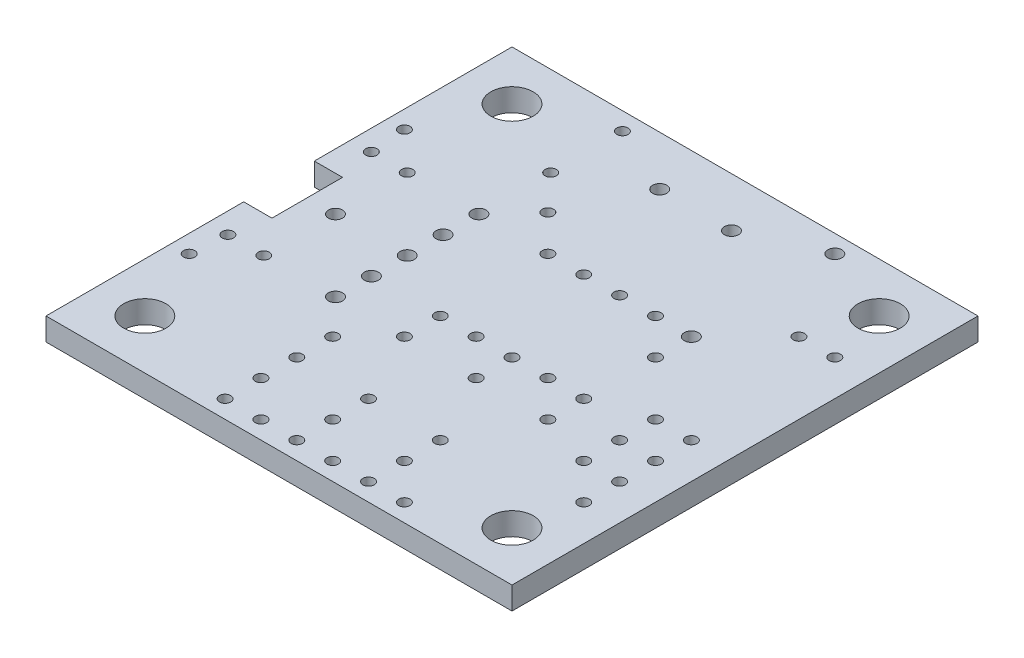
ISO-10303-21;
HEADER;
FILE_DESCRIPTION(('STEP AP214'),'2;1');
FILE_NAME('part.step','',(''),(''),'','','');
FILE_SCHEMA(('AUTOMOTIVE_DESIGN { 1 0 10303 214 1 1 1 1 }'));
ENDSEC;
DATA;
#1=APPLICATION_CONTEXT('core data for automotive mechanical design processes');
#2=APPLICATION_PROTOCOL_DEFINITION('international standard','automotive_design',2000,#1);
#3=PRODUCT_CONTEXT('',#1,'mechanical');
#4=PRODUCT('Part','Part','',(#3));
#5=PRODUCT_RELATED_PRODUCT_CATEGORY('part','',(#4));
#6=PRODUCT_DEFINITION_FORMATION('','',#4);
#7=PRODUCT_DEFINITION_CONTEXT('part definition',#1,'design');
#8=PRODUCT_DEFINITION('design','',#6,#7);
#9=PRODUCT_DEFINITION_SHAPE('','',#8);
#10=(LENGTH_UNIT() NAMED_UNIT(*) SI_UNIT(.MILLI.,.METRE.));
#11=(NAMED_UNIT(*) PLANE_ANGLE_UNIT() SI_UNIT($,.RADIAN.));
#12=(NAMED_UNIT(*) SI_UNIT($,.STERADIAN.) SOLID_ANGLE_UNIT());
#13=UNCERTAINTY_MEASURE_WITH_UNIT(LENGTH_MEASURE(1.E-05),#10,'distance_accuracy_value','');
#14=(GEOMETRIC_REPRESENTATION_CONTEXT(3) GLOBAL_UNCERTAINTY_ASSIGNED_CONTEXT((#13)) GLOBAL_UNIT_ASSIGNED_CONTEXT((#10,
#11,#12)) REPRESENTATION_CONTEXT('',''));
#15=CARTESIAN_POINT('',(0.,0.,0.));
#16=DIRECTION('',(0.,0.,1.));
#17=DIRECTION('',(1.,0.,0.));
#18=AXIS2_PLACEMENT_3D('',#15,#16,#17);
#19=CARTESIAN_POINT('',(0.,1.6,-14.));
#20=DIRECTION('',(0.,1.,0.));
#21=DIRECTION('',(0.,0.,1.));
#22=AXIS2_PLACEMENT_3D('',#19,#20,#21);
#23=PLANE('',#22);
#24=CARTESIAN_POINT('',(27.9300000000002,1.6,-10.1500000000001));
#25=DIRECTION('',(0.,1.,0.));
#26=DIRECTION('',(0.,0.,1.));
#27=AXIS2_PLACEMENT_3D('',#24,#25,#26);
#28=CIRCLE('',#27,0.399999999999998);
#29=CARTESIAN_POINT('',(27.9300000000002,1.6,-9.75000000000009));
#30=VERTEX_POINT('',#29);
#31=EDGE_CURVE('E516',#30,#30,#28,.T.);
#32=ORIENTED_EDGE('',*,*,#31,.F.);
#33=EDGE_LOOP('',(#32));
#34=FACE_BOUND('',#33,.T.);
#35=CARTESIAN_POINT('',(13.96,1.6,-29.5));
#36=DIRECTION('',(0.,1.,0.));
#37=DIRECTION('',(0.,0.,-1.));
#38=AXIS2_PLACEMENT_3D('',#35,#36,#37);
#39=CIRCLE('',#38,0.499999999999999);
#40=CARTESIAN_POINT('',(13.96,1.6,-30.));
#41=VERTEX_POINT('',#40);
#42=EDGE_CURVE('E504',#41,#41,#39,.T.);
#43=ORIENTED_EDGE('',*,*,#42,.F.);
#44=EDGE_LOOP('',(#43));
#45=FACE_BOUND('',#44,.T.);
#46=CARTESIAN_POINT('',(24.12,1.6,-13.96));
#47=DIRECTION('',(0.,1.,0.));
#48=DIRECTION('',(0.,0.,1.));
#49=AXIS2_PLACEMENT_3D('',#46,#47,#48);
#50=CIRCLE('',#49,0.399999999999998);
#51=CARTESIAN_POINT('',(24.12,1.6,-13.56));
#52=VERTEX_POINT('',#51);
#53=EDGE_CURVE('E492',#52,#52,#50,.T.);
#54=ORIENTED_EDGE('',*,*,#53,.F.);
#55=EDGE_LOOP('',(#54));
#56=FACE_BOUND('',#55,.T.);
#57=CARTESIAN_POINT('',(30.4700000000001,1.6,-25.3900000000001));
#58=DIRECTION('',(0.,1.,0.));
#59=DIRECTION('',(0.,0.,1.));
#60=AXIS2_PLACEMENT_3D('',#57,#58,#59);
#61=CIRCLE('',#60,0.399999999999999);
#62=CARTESIAN_POINT('',(30.4700000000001,1.6,-24.9900000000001));
#63=VERTEX_POINT('',#62);
#64=EDGE_CURVE('E480',#63,#63,#61,.T.);
#65=ORIENTED_EDGE('',*,*,#64,.F.);
#66=EDGE_LOOP('',(#65));
#67=FACE_BOUND('',#66,.T.);
#68=CARTESIAN_POINT('',(30.4700000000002,1.6,-12.6900000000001));
#69=DIRECTION('',(0.,1.,0.));
#70=DIRECTION('',(0.,0.,1.));
#71=AXIS2_PLACEMENT_3D('',#68,#69,#70);
#72=CIRCLE('',#71,0.399999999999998);
#73=CARTESIAN_POINT('',(30.4700000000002,1.6,-12.2900000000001));
#74=VERTEX_POINT('',#73);
#75=EDGE_CURVE('E468',#74,#74,#72,.T.);
#76=ORIENTED_EDGE('',*,*,#75,.F.);
#77=EDGE_LOOP('',(#76));
#78=FACE_BOUND('',#77,.T.);
#79=CARTESIAN_POINT('',(30.4700000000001,1.6,-15.2300000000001));
#80=DIRECTION('',(0.,1.,0.));
#81=DIRECTION('',(0.,0.,1.));
#82=AXIS2_PLACEMENT_3D('',#79,#80,#81);
#83=CIRCLE('',#82,0.399999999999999);
#84=CARTESIAN_POINT('',(30.4700000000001,1.6,-14.8300000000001));
#85=VERTEX_POINT('',#84);
#86=EDGE_CURVE('E456',#85,#85,#83,.T.);
#87=ORIENTED_EDGE('',*,*,#86,.F.);
#88=EDGE_LOOP('',(#87));
#89=FACE_BOUND('',#88,.T.);
#90=CARTESIAN_POINT('',(24.1199999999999,1.6,-31.74));
#91=DIRECTION('',(0.,1.,0.));
#92=DIRECTION('',(0.,0.,1.));
#93=AXIS2_PLACEMENT_3D('',#90,#91,#92);
#94=CIRCLE('',#93,0.499999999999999);
#95=CARTESIAN_POINT('',(24.1199999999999,1.6,-31.24));
#96=VERTEX_POINT('',#95);
#97=EDGE_CURVE('E444',#96,#96,#94,.T.);
#98=ORIENTED_EDGE('',*,*,#97,.F.);
#99=EDGE_LOOP('',(#98));
#100=FACE_BOUND('',#99,.T.);
#101=CARTESIAN_POINT('',(21.5799999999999,1.6,-21.58));
#102=DIRECTION('',(0.,1.,0.));
#103=DIRECTION('',(0.,0.,1.));
#104=AXIS2_PLACEMENT_3D('',#101,#102,#103);
#105=CIRCLE('',#104,0.400000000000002);
#106=CARTESIAN_POINT('',(21.5799999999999,1.6,-21.18));
#107=VERTEX_POINT('',#106);
#108=EDGE_CURVE('E432',#107,#107,#105,.T.);
#109=ORIENTED_EDGE('',*,*,#108,.F.);
#110=EDGE_LOOP('',(#109));
#111=FACE_BOUND('',#110,.T.);
#112=CARTESIAN_POINT('',(19.0399999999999,1.6,-21.58));
#113=DIRECTION('',(0.,1.,0.));
#114=DIRECTION('',(0.,0.,1.));
#115=AXIS2_PLACEMENT_3D('',#112,#113,#114);
#116=CIRCLE('',#115,0.399999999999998);
#117=CARTESIAN_POINT('',(19.0399999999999,1.6,-21.18));
#118=VERTEX_POINT('',#117);
#119=EDGE_CURVE('E420',#118,#118,#116,.T.);
#120=ORIENTED_EDGE('',*,*,#119,.F.);
#121=EDGE_LOOP('',(#120));
#122=FACE_BOUND('',#121,.T.);
#123=CARTESIAN_POINT('',(13.9599999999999,1.6,-21.58));
#124=DIRECTION('',(0.,1.,0.));
#125=DIRECTION('',(0.,0.,1.));
#126=AXIS2_PLACEMENT_3D('',#123,#124,#125);
#127=CIRCLE('',#126,0.4);
#128=CARTESIAN_POINT('',(13.9599999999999,1.6,-21.18));
#129=VERTEX_POINT('',#128);
#130=EDGE_CURVE('E408',#129,#129,#127,.T.);
#131=ORIENTED_EDGE('',*,*,#130,.F.);
#132=EDGE_LOOP('',(#131));
#133=FACE_BOUND('',#132,.T.);
#134=CARTESIAN_POINT('',(13.96,1.6,-13.96));
#135=DIRECTION('',(0.,1.,0.));
#136=DIRECTION('',(0.,0.,1.));
#137=AXIS2_PLACEMENT_3D('',#134,#135,#136);
#138=CIRCLE('',#137,0.399999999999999);
#139=CARTESIAN_POINT('',(13.96,1.6,-13.56));
#140=VERTEX_POINT('',#139);
#141=EDGE_CURVE('E396',#140,#140,#138,.T.);
#142=ORIENTED_EDGE('',*,*,#141,.F.);
#143=EDGE_LOOP('',(#142));
#144=FACE_BOUND('',#143,.T.);
#145=CARTESIAN_POINT('',(16.4999999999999,1.6,-21.58));
#146=DIRECTION('',(0.,1.,0.));
#147=DIRECTION('',(0.,0.,1.));
#148=AXIS2_PLACEMENT_3D('',#145,#146,#147);
#149=CIRCLE('',#148,0.399999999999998);
#150=CARTESIAN_POINT('',(16.4999999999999,1.6,-21.18));
#151=VERTEX_POINT('',#150);
#152=EDGE_CURVE('E384',#151,#151,#149,.T.);
#153=ORIENTED_EDGE('',*,*,#152,.F.);
#154=EDGE_LOOP('',(#153));
#155=FACE_BOUND('',#154,.T.);
#156=CARTESIAN_POINT('',(21.58,1.6,-1.26));
#157=DIRECTION('',(0.,1.,0.));
#158=DIRECTION('',(0.,0.,1.));
#159=AXIS2_PLACEMENT_3D('',#156,#157,#158);
#160=CIRCLE('',#159,0.400000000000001);
#161=CARTESIAN_POINT('',(21.58,1.6,-0.859999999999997));
#162=VERTEX_POINT('',#161);
#163=EDGE_CURVE('E372',#162,#162,#160,.T.);
#164=ORIENTED_EDGE('',*,*,#163,.F.);
#165=EDGE_LOOP('',(#164));
#166=FACE_BOUND('',#165,.T.);
#167=CARTESIAN_POINT('',(21.58,1.6,-3.8));
#168=DIRECTION('',(0.,1.,0.));
#169=DIRECTION('',(0.,0.,1.));
#170=AXIS2_PLACEMENT_3D('',#167,#168,#169);
#171=CIRCLE('',#170,0.400000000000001);
#172=CARTESIAN_POINT('',(21.58,1.6,-3.4));
#173=VERTEX_POINT('',#172);
#174=EDGE_CURVE('E360',#173,#173,#171,.T.);
#175=ORIENTED_EDGE('',*,*,#174,.F.);
#176=EDGE_LOOP('',(#175));
#177=FACE_BOUND('',#176,.T.);
#178=CARTESIAN_POINT('',(1.25999999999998,1.6,-24.1200000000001));
#179=DIRECTION('',(0.,1.,0.));
#180=DIRECTION('',(0.,0.,-1.));
#181=AXIS2_PLACEMENT_3D('',#178,#179,#180);
#182=CIRCLE('',#181,0.4);
#183=CARTESIAN_POINT('',(1.25999999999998,1.6,-24.5200000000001));
#184=VERTEX_POINT('',#183);
#185=EDGE_CURVE('E348',#184,#184,#182,.T.);
#186=ORIENTED_EDGE('',*,*,#185,.F.);
#187=EDGE_LOOP('',(#186));
#188=FACE_BOUND('',#187,.T.);
#189=CARTESIAN_POINT('',(11.42,1.6,-1.25999999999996));
#190=DIRECTION('',(0.,1.,0.));
#191=DIRECTION('',(0.,0.,1.));
#192=AXIS2_PLACEMENT_3D('',#189,#190,#191);
#193=CIRCLE('',#192,0.399999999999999);
#194=CARTESIAN_POINT('',(11.42,1.6,-0.859999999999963));
#195=VERTEX_POINT('',#194);
#196=EDGE_CURVE('E336',#195,#195,#193,.T.);
#197=ORIENTED_EDGE('',*,*,#196,.F.);
#198=EDGE_LOOP('',(#197));
#199=FACE_BOUND('',#198,.T.);
#200=CARTESIAN_POINT('',(11.42,1.6,-3.79999999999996));
#201=DIRECTION('',(0.,1.,0.));
#202=DIRECTION('',(0.,0.,1.));
#203=AXIS2_PLACEMENT_3D('',#200,#201,#202);
#204=CIRCLE('',#203,0.399999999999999);
#205=CARTESIAN_POINT('',(11.42,1.6,-3.39999999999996));
#206=VERTEX_POINT('',#205);
#207=EDGE_CURVE('E324',#206,#206,#204,.T.);
#208=ORIENTED_EDGE('',*,*,#207,.F.);
#209=EDGE_LOOP('',(#208));
#210=FACE_BOUND('',#209,.T.);
#211=CARTESIAN_POINT('',(24.12,1.6,-11.42));
#212=DIRECTION('',(0.,1.,0.));
#213=DIRECTION('',(0.,0.,1.));
#214=AXIS2_PLACEMENT_3D('',#211,#212,#213);
#215=CIRCLE('',#214,0.400000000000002);
#216=CARTESIAN_POINT('',(24.12,1.6,-11.02));
#217=VERTEX_POINT('',#216);
#218=EDGE_CURVE('E312',#217,#217,#215,.T.);
#219=ORIENTED_EDGE('',*,*,#218,.F.);
#220=EDGE_LOOP('',(#219));
#221=FACE_BOUND('',#220,.T.);
#222=CARTESIAN_POINT('',(16.5,1.6,-1.26));
#223=DIRECTION('',(0.,1.,0.));
#224=DIRECTION('',(0.,0.,1.));
#225=AXIS2_PLACEMENT_3D('',#222,#223,#224);
#226=CIRCLE('',#225,0.400000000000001);
#227=CARTESIAN_POINT('',(16.5,1.6,-0.859999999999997));
#228=VERTEX_POINT('',#227);
#229=EDGE_CURVE('E300',#228,#228,#226,.T.);
#230=ORIENTED_EDGE('',*,*,#229,.F.);
#231=EDGE_LOOP('',(#230));
#232=FACE_BOUND('',#231,.T.);
#233=CARTESIAN_POINT('',(16.5,1.6,-6.34));
#234=DIRECTION('',(0.,1.,0.));
#235=DIRECTION('',(0.,0.,1.));
#236=AXIS2_PLACEMENT_3D('',#233,#234,#235);
#237=CIRCLE('',#236,0.400000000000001);
#238=CARTESIAN_POINT('',(16.5,1.6,-5.94));
#239=VERTEX_POINT('',#238);
#240=EDGE_CURVE('E288',#239,#239,#237,.T.);
#241=ORIENTED_EDGE('',*,*,#240,.F.);
#242=EDGE_LOOP('',(#241));
#243=FACE_BOUND('',#242,.T.);
#244=CARTESIAN_POINT('',(11.42,1.6,-24.12));
#245=DIRECTION('',(0.,1.,0.));
#246=DIRECTION('',(0.,0.,-1.));
#247=AXIS2_PLACEMENT_3D('',#244,#245,#246);
#248=CIRCLE('',#247,0.4);
#249=CARTESIAN_POINT('',(11.42,1.6,-24.52));
#250=VERTEX_POINT('',#249);
#251=EDGE_CURVE('E276',#250,#250,#248,.T.);
#252=ORIENTED_EDGE('',*,*,#251,.F.);
#253=EDGE_LOOP('',(#252));
#254=FACE_BOUND('',#253,.T.);
#255=CARTESIAN_POINT('',(9.08000000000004,1.6,-26.66));
#256=DIRECTION('',(0.,1.,0.));
#257=DIRECTION('',(0.,0.,-1.));
#258=AXIS2_PLACEMENT_3D('',#255,#256,#257);
#259=CIRCLE('',#258,0.4);
#260=CARTESIAN_POINT('',(9.08000000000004,1.6,-27.06));
#261=VERTEX_POINT('',#260);
#262=EDGE_CURVE('E264',#261,#261,#259,.T.);
#263=ORIENTED_EDGE('',*,*,#262,.F.);
#264=EDGE_LOOP('',(#263));
#265=FACE_BOUND('',#264,.T.);
#266=CARTESIAN_POINT('',(9.08000000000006,1.6,-21.58));
#267=DIRECTION('',(0.,1.,0.));
#268=DIRECTION('',(0.,0.,-1.));
#269=AXIS2_PLACEMENT_3D('',#266,#267,#268);
#270=CIRCLE('',#269,0.499999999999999);
#271=CARTESIAN_POINT('',(9.08000000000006,1.6,-22.08));
#272=VERTEX_POINT('',#271);
#273=EDGE_CURVE('E252',#272,#272,#270,.T.);
#274=ORIENTED_EDGE('',*,*,#273,.F.);
#275=EDGE_LOOP('',(#274));
#276=FACE_BOUND('',#275,.T.);
#277=CARTESIAN_POINT('',(4.00000000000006,1.6,-11.42));
#278=DIRECTION('',(0.,1.,0.));
#279=DIRECTION('',(0.,0.,1.));
#280=AXIS2_PLACEMENT_3D('',#277,#278,#279);
#281=CIRCLE('',#280,0.4);
#282=CARTESIAN_POINT('',(4.00000000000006,1.6,-11.02));
#283=VERTEX_POINT('',#282);
#284=EDGE_CURVE('E240',#283,#283,#281,.T.);
#285=ORIENTED_EDGE('',*,*,#284,.F.);
#286=EDGE_LOOP('',(#285));
#287=FACE_BOUND('',#286,.T.);
#288=CARTESIAN_POINT('',(9.08000000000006,1.6,-11.42));
#289=DIRECTION('',(0.,1.,0.));
#290=DIRECTION('',(0.,0.,1.));
#291=AXIS2_PLACEMENT_3D('',#288,#289,#290);
#292=CIRCLE('',#291,0.499999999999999);
#293=CARTESIAN_POINT('',(9.08000000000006,1.6,-10.92));
#294=VERTEX_POINT('',#293);
#295=EDGE_CURVE('E228',#294,#294,#292,.T.);
#296=ORIENTED_EDGE('',*,*,#295,.F.);
#297=EDGE_LOOP('',(#296));
#298=FACE_BOUND('',#297,.T.);
#299=CARTESIAN_POINT('',(9.08000000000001,1.6,-16.5));
#300=DIRECTION('',(0.,1.,0.));
#301=DIRECTION('',(0.,0.,1.));
#302=AXIS2_PLACEMENT_3D('',#299,#300,#301);
#303=CIRCLE('',#302,0.499999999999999);
#304=CARTESIAN_POINT('',(9.08000000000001,1.6,-16.));
#305=VERTEX_POINT('',#304);
#306=EDGE_CURVE('E216',#305,#305,#303,.T.);
#307=ORIENTED_EDGE('',*,*,#306,.F.);
#308=EDGE_LOOP('',(#307));
#309=FACE_BOUND('',#308,.T.);
#310=CARTESIAN_POINT('',(4.,1.6,-16.5));
#311=DIRECTION('',(0.,1.,0.));
#312=DIRECTION('',(0.,0.,1.));
#313=AXIS2_PLACEMENT_3D('',#310,#311,#312);
#314=CIRCLE('',#313,0.500000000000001);
#315=CARTESIAN_POINT('',(4.,1.6,-16.));
#316=VERTEX_POINT('',#315);
#317=EDGE_CURVE('E204',#316,#316,#314,.T.);
#318=ORIENTED_EDGE('',*,*,#317,.F.);
#319=EDGE_LOOP('',(#318));
#320=FACE_BOUND('',#319,.T.);
#321=CARTESIAN_POINT('',(3.5,1.6,-29.5));
#322=DIRECTION('',(0.,1.,0.));
#323=DIRECTION('',(0.,0.,-1.));
#324=AXIS2_PLACEMENT_3D('',#321,#322,#323);
#325=CIRCLE('',#324,1.5);
#326=CARTESIAN_POINT('',(3.5,1.6,-31.));
#327=VERTEX_POINT('',#326);
#328=EDGE_CURVE('E192',#327,#327,#325,.T.);
#329=ORIENTED_EDGE('',*,*,#328,.F.);
#330=EDGE_LOOP('',(#329));
#331=FACE_BOUND('',#330,.T.);
#332=CARTESIAN_POINT('',(3.5,1.6,-3.5));
#333=DIRECTION('',(0.,1.,0.));
#334=DIRECTION('',(0.,0.,1.));
#335=AXIS2_PLACEMENT_3D('',#332,#333,#334);
#336=CIRCLE('',#335,1.5);
#337=CARTESIAN_POINT('',(3.5,1.6,-2.));
#338=VERTEX_POINT('',#337);
#339=EDGE_CURVE('E138',#338,#338,#336,.T.);
#340=ORIENTED_EDGE('',*,*,#339,.F.);
#341=EDGE_LOOP('',(#340));
#342=FACE_BOUND('',#341,.T.);
#343=DIRECTION('',(0.,0.,1.));
#344=VECTOR('',#343,1.);
#345=CARTESIAN_POINT('',(0.,1.6,0.));
#346=LINE('',#345,#344);
#347=CARTESIAN_POINT('',(0.,1.6,-14.));
#348=VERTEX_POINT('',#347);
#349=CARTESIAN_POINT('',(0.,1.6,0.));
#350=VERTEX_POINT('',#349);
#351=EDGE_CURVE('E149',#348,#350,#346,.T.);
#352=ORIENTED_EDGE('',*,*,#351,.T.);
#353=DIRECTION('',(1.,0.,0.));
#354=VECTOR('',#353,1.);
#355=CARTESIAN_POINT('',(0.,1.6,0.));
#356=LINE('',#355,#354);
#357=CARTESIAN_POINT('',(33.,1.6,0.));
#358=VERTEX_POINT('',#357);
#359=EDGE_CURVE('E97',#350,#358,#356,.T.);
#360=ORIENTED_EDGE('',*,*,#359,.T.);
#361=DIRECTION('',(0.,0.,-1.));
#362=VECTOR('',#361,1.);
#363=CARTESIAN_POINT('',(33.,1.6,0.));
#364=LINE('',#363,#362);
#365=CARTESIAN_POINT('',(33.,1.6,-33.));
#366=VERTEX_POINT('',#365);
#367=EDGE_CURVE('E164',#358,#366,#364,.T.);
#368=ORIENTED_EDGE('',*,*,#367,.T.);
#369=DIRECTION('',(-1.,0.,0.));
#370=VECTOR('',#369,1.);
#371=CARTESIAN_POINT('',(0.,1.6,-33.));
#372=LINE('',#371,#370);
#373=CARTESIAN_POINT('',(0.,1.6,-33.));
#374=VERTEX_POINT('',#373);
#375=EDGE_CURVE('E177',#366,#374,#372,.T.);
#376=ORIENTED_EDGE('',*,*,#375,.T.);
#377=DIRECTION('',(0.,0.,1.));
#378=VECTOR('',#377,1.);
#379=CARTESIAN_POINT('',(0.,1.6,-19.));
#380=LINE('',#379,#378);
#381=CARTESIAN_POINT('',(0.,1.6,-19.));
#382=VERTEX_POINT('',#381);
#383=EDGE_CURVE('E116',#374,#382,#380,.T.);
#384=ORIENTED_EDGE('',*,*,#383,.T.);
#385=DIRECTION('',(1.,0.,0.));
#386=VECTOR('',#385,1.);
#387=CARTESIAN_POINT('',(0.,1.6,-19.));
#388=LINE('',#387,#386);
#389=CARTESIAN_POINT('',(2.,1.6,-19.));
#390=VERTEX_POINT('',#389);
#391=EDGE_CURVE('E110',#382,#390,#388,.T.);
#392=ORIENTED_EDGE('',*,*,#391,.T.);
#393=DIRECTION('',(0.,0.,1.));
#394=VECTOR('',#393,1.);
#395=CARTESIAN_POINT('',(2.,1.6,-19.));
#396=LINE('',#395,#394);
#397=CARTESIAN_POINT('',(2.,1.6,-14.));
#398=VERTEX_POINT('',#397);
#399=EDGE_CURVE('E114',#390,#398,#396,.T.);
#400=ORIENTED_EDGE('',*,*,#399,.T.);
#401=DIRECTION('',(-1.,0.,0.));
#402=VECTOR('',#401,1.);
#403=CARTESIAN_POINT('',(2.,1.6,-14.));
#404=LINE('',#403,#402);
#405=EDGE_CURVE('E54',#398,#348,#404,.T.);
#406=ORIENTED_EDGE('',*,*,#405,.T.);
#407=EDGE_LOOP('',(#352,#360,#368,#376,#384,#392,#400,#406));
#408=FACE_BOUND('',#407,.T.);
#409=CARTESIAN_POINT('',(29.4999999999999,1.6,-3.49999999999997));
#410=DIRECTION('',(0.,1.,0.));
#411=DIRECTION('',(0.,0.,-1.));
#412=AXIS2_PLACEMENT_3D('',#409,#410,#411);
#413=CIRCLE('',#412,1.5);
#414=CARTESIAN_POINT('',(29.4999999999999,1.6,-4.99999999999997));
#415=VERTEX_POINT('',#414);
#416=EDGE_CURVE('E186',#415,#415,#413,.T.);
#417=ORIENTED_EDGE('',*,*,#416,.F.);
#418=EDGE_LOOP('',(#417));
#419=FACE_BOUND('',#418,.T.);
#420=CARTESIAN_POINT('',(29.4999999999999,1.6,-29.5));
#421=DIRECTION('',(0.,1.,0.));
#422=DIRECTION('',(0.,0.,1.));
#423=AXIS2_PLACEMENT_3D('',#420,#421,#422);
#424=CIRCLE('',#423,1.5);
#425=CARTESIAN_POINT('',(29.4999999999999,1.6,-28.));
#426=VERTEX_POINT('',#425);
#427=EDGE_CURVE('E198',#426,#426,#424,.T.);
#428=ORIENTED_EDGE('',*,*,#427,.F.);
#429=EDGE_LOOP('',(#428));
#430=FACE_BOUND('',#429,.T.);
#431=CARTESIAN_POINT('',(1.46000000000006,1.6,-21.5800000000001));
#432=DIRECTION('',(0.,1.,0.));
#433=DIRECTION('',(0.,0.,-1.));
#434=AXIS2_PLACEMENT_3D('',#431,#432,#433);
#435=CIRCLE('',#434,0.4);
#436=CARTESIAN_POINT('',(1.46000000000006,1.6,-21.9800000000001));
#437=VERTEX_POINT('',#436);
#438=EDGE_CURVE('E210',#437,#437,#435,.T.);
#439=ORIENTED_EDGE('',*,*,#438,.F.);
#440=EDGE_LOOP('',(#439));
#441=FACE_BOUND('',#440,.T.);
#442=CARTESIAN_POINT('',(9.08000000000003,1.6,-13.96));
#443=DIRECTION('',(0.,1.,0.));
#444=DIRECTION('',(0.,0.,1.));
#445=AXIS2_PLACEMENT_3D('',#442,#443,#444);
#446=CIRCLE('',#445,0.499999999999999);
#447=CARTESIAN_POINT('',(9.08000000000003,1.6,-13.46));
#448=VERTEX_POINT('',#447);
#449=EDGE_CURVE('E222',#448,#448,#446,.T.);
#450=ORIENTED_EDGE('',*,*,#449,.F.);
#451=EDGE_LOOP('',(#450));
#452=FACE_BOUND('',#451,.T.);
#453=CARTESIAN_POINT('',(4.00000000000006,1.6,-21.58));
#454=DIRECTION('',(0.,1.,0.));
#455=DIRECTION('',(0.,0.,-1.));
#456=AXIS2_PLACEMENT_3D('',#453,#454,#455);
#457=CIRCLE('',#456,0.400000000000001);
#458=CARTESIAN_POINT('',(4.00000000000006,1.6,-21.98));
#459=VERTEX_POINT('',#458);
#460=EDGE_CURVE('E234',#459,#459,#457,.T.);
#461=ORIENTED_EDGE('',*,*,#460,.F.);
#462=EDGE_LOOP('',(#461));
#463=FACE_BOUND('',#462,.T.);
#464=CARTESIAN_POINT('',(1.46000000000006,1.6,-11.4199999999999));
#465=DIRECTION('',(0.,1.,0.));
#466=DIRECTION('',(0.,0.,1.));
#467=AXIS2_PLACEMENT_3D('',#464,#465,#466);
#468=CIRCLE('',#467,0.4);
#469=CARTESIAN_POINT('',(1.46000000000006,1.6,-11.0199999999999));
#470=VERTEX_POINT('',#469);
#471=EDGE_CURVE('E246',#470,#470,#468,.T.);
#472=ORIENTED_EDGE('',*,*,#471,.F.);
#473=EDGE_LOOP('',(#472));
#474=FACE_BOUND('',#473,.T.);
#475=CARTESIAN_POINT('',(9.08000000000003,1.6,-19.04));
#476=DIRECTION('',(0.,1.,0.));
#477=DIRECTION('',(0.,0.,-1.));
#478=AXIS2_PLACEMENT_3D('',#475,#476,#477);
#479=CIRCLE('',#478,0.499999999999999);
#480=CARTESIAN_POINT('',(9.08000000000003,1.6,-19.54));
#481=VERTEX_POINT('',#480);
#482=EDGE_CURVE('E258',#481,#481,#479,.T.);
#483=ORIENTED_EDGE('',*,*,#482,.F.);
#484=EDGE_LOOP('',(#483));
#485=FACE_BOUND('',#484,.T.);
#486=CARTESIAN_POINT('',(9.08000000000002,1.6,-31.74));
#487=DIRECTION('',(0.,1.,0.));
#488=DIRECTION('',(0.,0.,-1.));
#489=AXIS2_PLACEMENT_3D('',#486,#487,#488);
#490=CIRCLE('',#489,0.399999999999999);
#491=CARTESIAN_POINT('',(9.08000000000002,1.6,-32.14));
#492=VERTEX_POINT('',#491);
#493=EDGE_CURVE('E270',#492,#492,#490,.T.);
#494=ORIENTED_EDGE('',*,*,#493,.F.);
#495=EDGE_LOOP('',(#494));
#496=FACE_BOUND('',#495,.T.);
#497=CARTESIAN_POINT('',(16.5,1.6,-3.8));
#498=DIRECTION('',(0.,1.,0.));
#499=DIRECTION('',(0.,0.,1.));
#500=AXIS2_PLACEMENT_3D('',#497,#498,#499);
#501=CIRCLE('',#500,0.400000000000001);
#502=CARTESIAN_POINT('',(16.5,1.6,-3.4));
#503=VERTEX_POINT('',#502);
#504=EDGE_CURVE('E282',#503,#503,#501,.T.);
#505=ORIENTED_EDGE('',*,*,#504,.F.);
#506=EDGE_LOOP('',(#505));
#507=FACE_BOUND('',#506,.T.);
#508=CARTESIAN_POINT('',(13.96,1.6,-11.42));
#509=DIRECTION('',(0.,1.,0.));
#510=DIRECTION('',(0.,0.,1.));
#511=AXIS2_PLACEMENT_3D('',#508,#509,#510);
#512=CIRCLE('',#511,0.399999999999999);
#513=CARTESIAN_POINT('',(13.96,1.6,-11.02));
#514=VERTEX_POINT('',#513);
#515=EDGE_CURVE('E294',#514,#514,#512,.T.);
#516=ORIENTED_EDGE('',*,*,#515,.F.);
#517=EDGE_LOOP('',(#516));
#518=FACE_BOUND('',#517,.T.);
#519=CARTESIAN_POINT('',(19.04,1.6,-11.42));
#520=DIRECTION('',(0.,1.,0.));
#521=DIRECTION('',(0.,0.,1.));
#522=AXIS2_PLACEMENT_3D('',#519,#520,#521);
#523=CIRCLE('',#522,0.400000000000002);
#524=CARTESIAN_POINT('',(19.04,1.6,-11.02));
#525=VERTEX_POINT('',#524);
#526=EDGE_CURVE('E306',#525,#525,#523,.T.);
#527=ORIENTED_EDGE('',*,*,#526,.F.);
#528=EDGE_LOOP('',(#527));
#529=FACE_BOUND('',#528,.T.);
#530=CARTESIAN_POINT('',(13.96,1.6,-1.25999999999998));
#531=DIRECTION('',(0.,1.,0.));
#532=DIRECTION('',(0.,0.,1.));
#533=AXIS2_PLACEMENT_3D('',#530,#531,#532);
#534=CIRCLE('',#533,0.399999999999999);
#535=CARTESIAN_POINT('',(13.96,1.6,-0.859999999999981));
#536=VERTEX_POINT('',#535);
#537=EDGE_CURVE('E318',#536,#536,#534,.T.);
#538=ORIENTED_EDGE('',*,*,#537,.F.);
#539=EDGE_LOOP('',(#538));
#540=FACE_BOUND('',#539,.T.);
#541=CARTESIAN_POINT('',(11.42,1.6,-6.33999999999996));
#542=DIRECTION('',(0.,1.,0.));
#543=DIRECTION('',(0.,0.,1.));
#544=AXIS2_PLACEMENT_3D('',#541,#542,#543);
#545=CIRCLE('',#544,0.4);
#546=CARTESIAN_POINT('',(11.42,1.6,-5.93999999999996));
#547=VERTEX_POINT('',#546);
#548=EDGE_CURVE('E330',#547,#547,#545,.T.);
#549=ORIENTED_EDGE('',*,*,#548,.F.);
#550=EDGE_LOOP('',(#549));
#551=FACE_BOUND('',#550,.T.);
#552=CARTESIAN_POINT('',(1.25999999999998,1.6,-8.87999999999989));
#553=DIRECTION('',(0.,1.,0.));
#554=DIRECTION('',(0.,0.,1.));
#555=AXIS2_PLACEMENT_3D('',#552,#553,#554);
#556=CIRCLE('',#555,0.4);
#557=CARTESIAN_POINT('',(1.25999999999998,1.6,-8.47999999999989));
#558=VERTEX_POINT('',#557);
#559=EDGE_CURVE('E342',#558,#558,#556,.T.);
#560=ORIENTED_EDGE('',*,*,#559,.F.);
#561=EDGE_LOOP('',(#560));
#562=FACE_BOUND('',#561,.T.);
#563=CARTESIAN_POINT('',(19.04,1.6,-1.26));
#564=DIRECTION('',(0.,1.,0.));
#565=DIRECTION('',(0.,0.,1.));
#566=AXIS2_PLACEMENT_3D('',#563,#564,#565);
#567=CIRCLE('',#566,0.400000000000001);
#568=CARTESIAN_POINT('',(19.04,1.6,-0.859999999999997));
#569=VERTEX_POINT('',#568);
#570=EDGE_CURVE('E354',#569,#569,#567,.T.);
#571=ORIENTED_EDGE('',*,*,#570,.F.);
#572=EDGE_LOOP('',(#571));
#573=FACE_BOUND('',#572,.T.);
#574=CARTESIAN_POINT('',(21.58,1.6,-6.34));
#575=DIRECTION('',(0.,1.,0.));
#576=DIRECTION('',(0.,0.,1.));
#577=AXIS2_PLACEMENT_3D('',#574,#575,#576);
#578=CIRCLE('',#577,0.400000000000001);
#579=CARTESIAN_POINT('',(21.58,1.6,-5.94));
#580=VERTEX_POINT('',#579);
#581=EDGE_CURVE('E366',#580,#580,#578,.T.);
#582=ORIENTED_EDGE('',*,*,#581,.F.);
#583=EDGE_LOOP('',(#582));
#584=FACE_BOUND('',#583,.T.);
#585=CARTESIAN_POINT('',(16.5,1.6,-13.96));
#586=DIRECTION('',(0.,1.,0.));
#587=DIRECTION('',(0.,0.,1.));
#588=AXIS2_PLACEMENT_3D('',#585,#586,#587);
#589=CIRCLE('',#588,0.400000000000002);
#590=CARTESIAN_POINT('',(16.5,1.6,-13.56));
#591=VERTEX_POINT('',#590);
#592=EDGE_CURVE('E378',#591,#591,#589,.T.);
#593=ORIENTED_EDGE('',*,*,#592,.F.);
#594=EDGE_LOOP('',(#593));
#595=FACE_BOUND('',#594,.T.);
#596=CARTESIAN_POINT('',(24.12,1.6,-1.26));
#597=DIRECTION('',(0.,1.,0.));
#598=DIRECTION('',(0.,0.,1.));
#599=AXIS2_PLACEMENT_3D('',#596,#597,#598);
#600=CIRCLE('',#599,0.400000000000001);
#601=CARTESIAN_POINT('',(24.12,1.6,-0.859999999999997));
#602=VERTEX_POINT('',#601);
#603=EDGE_CURVE('E390',#602,#602,#600,.T.);
#604=ORIENTED_EDGE('',*,*,#603,.F.);
#605=EDGE_LOOP('',(#604));
#606=FACE_BOUND('',#605,.T.);
#607=CARTESIAN_POINT('',(11.42,1.6,-8.87999999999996));
#608=DIRECTION('',(0.,1.,0.));
#609=DIRECTION('',(0.,0.,1.));
#610=AXIS2_PLACEMENT_3D('',#607,#608,#609);
#611=CIRCLE('',#610,0.399999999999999);
#612=CARTESIAN_POINT('',(11.42,1.6,-8.47999999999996));
#613=VERTEX_POINT('',#612);
#614=EDGE_CURVE('E402',#613,#613,#611,.T.);
#615=ORIENTED_EDGE('',*,*,#614,.F.);
#616=EDGE_LOOP('',(#615));
#617=FACE_BOUND('',#616,.T.);
#618=CARTESIAN_POINT('',(19.04,1.6,-13.96));
#619=DIRECTION('',(0.,1.,0.));
#620=DIRECTION('',(0.,0.,1.));
#621=AXIS2_PLACEMENT_3D('',#618,#619,#620);
#622=CIRCLE('',#621,0.400000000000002);
#623=CARTESIAN_POINT('',(19.04,1.6,-13.56));
#624=VERTEX_POINT('',#623);
#625=EDGE_CURVE('E414',#624,#624,#622,.T.);
#626=ORIENTED_EDGE('',*,*,#625,.F.);
#627=EDGE_LOOP('',(#626));
#628=FACE_BOUND('',#627,.T.);
#629=CARTESIAN_POINT('',(21.58,1.6,-13.96));
#630=DIRECTION('',(0.,1.,0.));
#631=DIRECTION('',(0.,0.,1.));
#632=AXIS2_PLACEMENT_3D('',#629,#630,#631);
#633=CIRCLE('',#632,0.399999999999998);
#634=CARTESIAN_POINT('',(21.58,1.6,-13.56));
#635=VERTEX_POINT('',#634);
#636=EDGE_CURVE('E426',#635,#635,#633,.T.);
#637=ORIENTED_EDGE('',*,*,#636,.F.);
#638=EDGE_LOOP('',(#637));
#639=FACE_BOUND('',#638,.T.);
#640=CARTESIAN_POINT('',(24.1199999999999,1.6,-21.58));
#641=DIRECTION('',(0.,1.,0.));
#642=DIRECTION('',(0.,0.,1.));
#643=AXIS2_PLACEMENT_3D('',#640,#641,#642);
#644=CIRCLE('',#643,0.499999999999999);
#645=CARTESIAN_POINT('',(24.1199999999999,1.6,-21.08));
#646=VERTEX_POINT('',#645);
#647=EDGE_CURVE('E438',#646,#646,#644,.T.);
#648=ORIENTED_EDGE('',*,*,#647,.F.);
#649=EDGE_LOOP('',(#648));
#650=FACE_BOUND('',#649,.T.);
#651=CARTESIAN_POINT('',(19.04,1.6,-29.5));
#652=DIRECTION('',(0.,1.,0.));
#653=DIRECTION('',(0.,0.,1.));
#654=AXIS2_PLACEMENT_3D('',#651,#652,#653);
#655=CIRCLE('',#654,0.499999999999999);
#656=CARTESIAN_POINT('',(19.04,1.6,-29.));
#657=VERTEX_POINT('',#656);
#658=EDGE_CURVE('E450',#657,#657,#655,.T.);
#659=ORIENTED_EDGE('',*,*,#658,.F.);
#660=EDGE_LOOP('',(#659));
#661=FACE_BOUND('',#660,.T.);
#662=CARTESIAN_POINT('',(27.9300000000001,1.6,-15.2300000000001));
#663=DIRECTION('',(0.,1.,0.));
#664=DIRECTION('',(0.,0.,1.));
#665=AXIS2_PLACEMENT_3D('',#662,#663,#664);
#666=CIRCLE('',#665,0.399999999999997);
#667=CARTESIAN_POINT('',(27.9300000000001,1.6,-14.8300000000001));
#668=VERTEX_POINT('',#667);
#669=EDGE_CURVE('E462',#668,#668,#666,.T.);
#670=ORIENTED_EDGE('',*,*,#669,.F.);
#671=EDGE_LOOP('',(#670));
#672=FACE_BOUND('',#671,.T.);
#673=CARTESIAN_POINT('',(27.9300000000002,1.6,-12.6900000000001));
#674=DIRECTION('',(0.,1.,0.));
#675=DIRECTION('',(0.,0.,1.));
#676=AXIS2_PLACEMENT_3D('',#673,#674,#675);
#677=CIRCLE('',#676,0.399999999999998);
#678=CARTESIAN_POINT('',(27.9300000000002,1.6,-12.2900000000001));
#679=VERTEX_POINT('',#678);
#680=EDGE_CURVE('E474',#679,#679,#677,.T.);
#681=ORIENTED_EDGE('',*,*,#680,.F.);
#682=EDGE_LOOP('',(#681));
#683=FACE_BOUND('',#682,.T.);
#684=CARTESIAN_POINT('',(27.9300000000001,1.6,-25.3900000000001));
#685=DIRECTION('',(0.,1.,0.));
#686=DIRECTION('',(0.,0.,1.));
#687=AXIS2_PLACEMENT_3D('',#684,#685,#686);
#688=CIRCLE('',#687,0.399999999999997);
#689=CARTESIAN_POINT('',(27.9300000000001,1.6,-24.9900000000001));
#690=VERTEX_POINT('',#689);
#691=EDGE_CURVE('E486',#690,#690,#688,.T.);
#692=ORIENTED_EDGE('',*,*,#691,.F.);
#693=EDGE_LOOP('',(#692));
#694=FACE_BOUND('',#693,.T.);
#695=CARTESIAN_POINT('',(24.1199999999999,1.6,-19.04));
#696=DIRECTION('',(0.,1.,0.));
#697=DIRECTION('',(0.,0.,1.));
#698=AXIS2_PLACEMENT_3D('',#695,#696,#697);
#699=CIRCLE('',#698,0.399999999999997);
#700=CARTESIAN_POINT('',(24.1199999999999,1.6,-18.64));
#701=VERTEX_POINT('',#700);
#702=EDGE_CURVE('E498',#701,#701,#699,.T.);
#703=ORIENTED_EDGE('',*,*,#702,.F.);
#704=EDGE_LOOP('',(#703));
#705=FACE_BOUND('',#704,.T.);
#706=CARTESIAN_POINT('',(30.4700000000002,1.6,-10.1500000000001));
#707=DIRECTION('',(0.,1.,0.));
#708=DIRECTION('',(0.,0.,1.));
#709=AXIS2_PLACEMENT_3D('',#706,#707,#708);
#710=CIRCLE('',#709,0.399999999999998);
#711=CARTESIAN_POINT('',(30.4700000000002,1.6,-9.75000000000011));
#712=VERTEX_POINT('',#711);
#713=EDGE_CURVE('E510',#712,#712,#710,.T.);
#714=ORIENTED_EDGE('',*,*,#713,.F.);
#715=EDGE_LOOP('',(#714));
#716=FACE_BOUND('',#715,.T.);
#717=CARTESIAN_POINT('',(30.4700000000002,1.6,-7.61000000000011));
#718=DIRECTION('',(0.,1.,0.));
#719=DIRECTION('',(0.,0.,1.));
#720=AXIS2_PLACEMENT_3D('',#717,#718,#719);
#721=CIRCLE('',#720,0.399999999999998);
#722=CARTESIAN_POINT('',(30.4700000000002,1.6,-7.21000000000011));
#723=VERTEX_POINT('',#722);
#724=EDGE_CURVE('E522',#723,#723,#721,.T.);
#725=ORIENTED_EDGE('',*,*,#724,.F.);
#726=EDGE_LOOP('',(#725));
#727=FACE_BOUND('',#726,.T.);
#728=ADVANCED_FACE('F37',(#34,#45,#56,#67,#78,#89,#100,#111,#122,#133,#144,#155,#166,#177,#188,
#199,#210,#221,#232,#243,#254,#265,#276,#287,#298,#309,#320,#331,#342,#408,#419,#430,#441,#452,
#463,#474,#485,#496,#507,#518,#529,#540,#551,#562,#573,#584,#595,#606,#617,#628,#639,#650,#661,
#672,#683,#694,#705,#716,#727),#23,.T.);
#729=CARTESIAN_POINT('',(0.,0.,-14.));
#730=DIRECTION('',(0.,1.,0.));
#731=DIRECTION('',(0.,0.,1.));
#732=AXIS2_PLACEMENT_3D('',#729,#730,#731);
#733=PLANE('',#732);
#734=CARTESIAN_POINT('',(27.9300000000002,0.,-10.1500000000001));
#735=DIRECTION('',(0.,1.,0.));
#736=DIRECTION('',(0.,0.,1.));
#737=AXIS2_PLACEMENT_3D('',#734,#735,#736);
#738=CIRCLE('',#737,0.399999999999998);
#739=CARTESIAN_POINT('',(27.9300000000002,0.,-9.75000000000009));
#740=VERTEX_POINT('',#739);
#741=EDGE_CURVE('E519',#740,#740,#738,.T.);
#742=ORIENTED_EDGE('',*,*,#741,.T.);
#743=EDGE_LOOP('',(#742));
#744=FACE_BOUND('',#743,.T.);
#745=CARTESIAN_POINT('',(13.96,0.,-29.5));
#746=DIRECTION('',(0.,1.,0.));
#747=DIRECTION('',(0.,0.,-1.));
#748=AXIS2_PLACEMENT_3D('',#745,#746,#747);
#749=CIRCLE('',#748,0.499999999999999);
#750=CARTESIAN_POINT('',(13.96,0.,-30.));
#751=VERTEX_POINT('',#750);
#752=EDGE_CURVE('E507',#751,#751,#749,.T.);
#753=ORIENTED_EDGE('',*,*,#752,.T.);
#754=EDGE_LOOP('',(#753));
#755=FACE_BOUND('',#754,.T.);
#756=CARTESIAN_POINT('',(24.12,0.,-13.96));
#757=DIRECTION('',(0.,1.,0.));
#758=DIRECTION('',(0.,0.,1.));
#759=AXIS2_PLACEMENT_3D('',#756,#757,#758);
#760=CIRCLE('',#759,0.399999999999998);
#761=CARTESIAN_POINT('',(24.12,0.,-13.56));
#762=VERTEX_POINT('',#761);
#763=EDGE_CURVE('E495',#762,#762,#760,.T.);
#764=ORIENTED_EDGE('',*,*,#763,.T.);
#765=EDGE_LOOP('',(#764));
#766=FACE_BOUND('',#765,.T.);
#767=CARTESIAN_POINT('',(30.4700000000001,0.,-25.3900000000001));
#768=DIRECTION('',(0.,1.,0.));
#769=DIRECTION('',(0.,0.,1.));
#770=AXIS2_PLACEMENT_3D('',#767,#768,#769);
#771=CIRCLE('',#770,0.399999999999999);
#772=CARTESIAN_POINT('',(30.4700000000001,0.,-24.9900000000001));
#773=VERTEX_POINT('',#772);
#774=EDGE_CURVE('E483',#773,#773,#771,.T.);
#775=ORIENTED_EDGE('',*,*,#774,.T.);
#776=EDGE_LOOP('',(#775));
#777=FACE_BOUND('',#776,.T.);
#778=CARTESIAN_POINT('',(30.4700000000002,0.,-12.6900000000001));
#779=DIRECTION('',(0.,1.,0.));
#780=DIRECTION('',(0.,0.,1.));
#781=AXIS2_PLACEMENT_3D('',#778,#779,#780);
#782=CIRCLE('',#781,0.399999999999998);
#783=CARTESIAN_POINT('',(30.4700000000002,0.,-12.2900000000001));
#784=VERTEX_POINT('',#783);
#785=EDGE_CURVE('E471',#784,#784,#782,.T.);
#786=ORIENTED_EDGE('',*,*,#785,.T.);
#787=EDGE_LOOP('',(#786));
#788=FACE_BOUND('',#787,.T.);
#789=CARTESIAN_POINT('',(30.4700000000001,0.,-15.2300000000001));
#790=DIRECTION('',(0.,1.,0.));
#791=DIRECTION('',(0.,0.,1.));
#792=AXIS2_PLACEMENT_3D('',#789,#790,#791);
#793=CIRCLE('',#792,0.399999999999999);
#794=CARTESIAN_POINT('',(30.4700000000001,0.,-14.8300000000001));
#795=VERTEX_POINT('',#794);
#796=EDGE_CURVE('E459',#795,#795,#793,.T.);
#797=ORIENTED_EDGE('',*,*,#796,.T.);
#798=EDGE_LOOP('',(#797));
#799=FACE_BOUND('',#798,.T.);
#800=CARTESIAN_POINT('',(24.1199999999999,0.,-31.74));
#801=DIRECTION('',(0.,1.,0.));
#802=DIRECTION('',(0.,0.,1.));
#803=AXIS2_PLACEMENT_3D('',#800,#801,#802);
#804=CIRCLE('',#803,0.499999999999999);
#805=CARTESIAN_POINT('',(24.1199999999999,0.,-31.24));
#806=VERTEX_POINT('',#805);
#807=EDGE_CURVE('E447',#806,#806,#804,.T.);
#808=ORIENTED_EDGE('',*,*,#807,.T.);
#809=EDGE_LOOP('',(#808));
#810=FACE_BOUND('',#809,.T.);
#811=CARTESIAN_POINT('',(21.5799999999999,0.,-21.58));
#812=DIRECTION('',(0.,1.,0.));
#813=DIRECTION('',(0.,0.,1.));
#814=AXIS2_PLACEMENT_3D('',#811,#812,#813);
#815=CIRCLE('',#814,0.400000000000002);
#816=CARTESIAN_POINT('',(21.5799999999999,0.,-21.18));
#817=VERTEX_POINT('',#816);
#818=EDGE_CURVE('E435',#817,#817,#815,.T.);
#819=ORIENTED_EDGE('',*,*,#818,.T.);
#820=EDGE_LOOP('',(#819));
#821=FACE_BOUND('',#820,.T.);
#822=CARTESIAN_POINT('',(19.0399999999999,0.,-21.58));
#823=DIRECTION('',(0.,1.,0.));
#824=DIRECTION('',(0.,0.,1.));
#825=AXIS2_PLACEMENT_3D('',#822,#823,#824);
#826=CIRCLE('',#825,0.399999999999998);
#827=CARTESIAN_POINT('',(19.0399999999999,0.,-21.18));
#828=VERTEX_POINT('',#827);
#829=EDGE_CURVE('E423',#828,#828,#826,.T.);
#830=ORIENTED_EDGE('',*,*,#829,.T.);
#831=EDGE_LOOP('',(#830));
#832=FACE_BOUND('',#831,.T.);
#833=CARTESIAN_POINT('',(13.9599999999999,0.,-21.58));
#834=DIRECTION('',(0.,1.,0.));
#835=DIRECTION('',(0.,0.,1.));
#836=AXIS2_PLACEMENT_3D('',#833,#834,#835);
#837=CIRCLE('',#836,0.4);
#838=CARTESIAN_POINT('',(13.9599999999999,0.,-21.18));
#839=VERTEX_POINT('',#838);
#840=EDGE_CURVE('E411',#839,#839,#837,.T.);
#841=ORIENTED_EDGE('',*,*,#840,.T.);
#842=EDGE_LOOP('',(#841));
#843=FACE_BOUND('',#842,.T.);
#844=CARTESIAN_POINT('',(13.96,0.,-13.96));
#845=DIRECTION('',(0.,1.,0.));
#846=DIRECTION('',(0.,0.,1.));
#847=AXIS2_PLACEMENT_3D('',#844,#845,#846);
#848=CIRCLE('',#847,0.399999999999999);
#849=CARTESIAN_POINT('',(13.96,0.,-13.56));
#850=VERTEX_POINT('',#849);
#851=EDGE_CURVE('E399',#850,#850,#848,.T.);
#852=ORIENTED_EDGE('',*,*,#851,.T.);
#853=EDGE_LOOP('',(#852));
#854=FACE_BOUND('',#853,.T.);
#855=CARTESIAN_POINT('',(16.4999999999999,0.,-21.58));
#856=DIRECTION('',(0.,1.,0.));
#857=DIRECTION('',(0.,0.,1.));
#858=AXIS2_PLACEMENT_3D('',#855,#856,#857);
#859=CIRCLE('',#858,0.399999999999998);
#860=CARTESIAN_POINT('',(16.4999999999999,0.,-21.18));
#861=VERTEX_POINT('',#860);
#862=EDGE_CURVE('E387',#861,#861,#859,.T.);
#863=ORIENTED_EDGE('',*,*,#862,.T.);
#864=EDGE_LOOP('',(#863));
#865=FACE_BOUND('',#864,.T.);
#866=CARTESIAN_POINT('',(21.58,0.,-1.26));
#867=DIRECTION('',(0.,1.,0.));
#868=DIRECTION('',(0.,0.,1.));
#869=AXIS2_PLACEMENT_3D('',#866,#867,#868);
#870=CIRCLE('',#869,0.400000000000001);
#871=CARTESIAN_POINT('',(21.58,0.,-0.859999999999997));
#872=VERTEX_POINT('',#871);
#873=EDGE_CURVE('E375',#872,#872,#870,.T.);
#874=ORIENTED_EDGE('',*,*,#873,.T.);
#875=EDGE_LOOP('',(#874));
#876=FACE_BOUND('',#875,.T.);
#877=CARTESIAN_POINT('',(21.58,0.,-3.8));
#878=DIRECTION('',(0.,1.,0.));
#879=DIRECTION('',(0.,0.,1.));
#880=AXIS2_PLACEMENT_3D('',#877,#878,#879);
#881=CIRCLE('',#880,0.400000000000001);
#882=CARTESIAN_POINT('',(21.58,0.,-3.4));
#883=VERTEX_POINT('',#882);
#884=EDGE_CURVE('E363',#883,#883,#881,.T.);
#885=ORIENTED_EDGE('',*,*,#884,.T.);
#886=EDGE_LOOP('',(#885));
#887=FACE_BOUND('',#886,.T.);
#888=CARTESIAN_POINT('',(1.25999999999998,0.,-24.1200000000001));
#889=DIRECTION('',(0.,1.,0.));
#890=DIRECTION('',(0.,0.,-1.));
#891=AXIS2_PLACEMENT_3D('',#888,#889,#890);
#892=CIRCLE('',#891,0.4);
#893=CARTESIAN_POINT('',(1.25999999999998,0.,-24.5200000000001));
#894=VERTEX_POINT('',#893);
#895=EDGE_CURVE('E351',#894,#894,#892,.T.);
#896=ORIENTED_EDGE('',*,*,#895,.T.);
#897=EDGE_LOOP('',(#896));
#898=FACE_BOUND('',#897,.T.);
#899=CARTESIAN_POINT('',(11.42,0.,-1.25999999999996));
#900=DIRECTION('',(0.,1.,0.));
#901=DIRECTION('',(0.,0.,1.));
#902=AXIS2_PLACEMENT_3D('',#899,#900,#901);
#903=CIRCLE('',#902,0.399999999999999);
#904=CARTESIAN_POINT('',(11.42,0.,-0.859999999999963));
#905=VERTEX_POINT('',#904);
#906=EDGE_CURVE('E339',#905,#905,#903,.T.);
#907=ORIENTED_EDGE('',*,*,#906,.T.);
#908=EDGE_LOOP('',(#907));
#909=FACE_BOUND('',#908,.T.);
#910=CARTESIAN_POINT('',(11.42,0.,-3.79999999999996));
#911=DIRECTION('',(0.,1.,0.));
#912=DIRECTION('',(0.,0.,1.));
#913=AXIS2_PLACEMENT_3D('',#910,#911,#912);
#914=CIRCLE('',#913,0.399999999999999);
#915=CARTESIAN_POINT('',(11.42,0.,-3.39999999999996));
#916=VERTEX_POINT('',#915);
#917=EDGE_CURVE('E327',#916,#916,#914,.T.);
#918=ORIENTED_EDGE('',*,*,#917,.T.);
#919=EDGE_LOOP('',(#918));
#920=FACE_BOUND('',#919,.T.);
#921=CARTESIAN_POINT('',(24.12,0.,-11.42));
#922=DIRECTION('',(0.,1.,0.));
#923=DIRECTION('',(0.,0.,1.));
#924=AXIS2_PLACEMENT_3D('',#921,#922,#923);
#925=CIRCLE('',#924,0.400000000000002);
#926=CARTESIAN_POINT('',(24.12,0.,-11.02));
#927=VERTEX_POINT('',#926);
#928=EDGE_CURVE('E315',#927,#927,#925,.T.);
#929=ORIENTED_EDGE('',*,*,#928,.T.);
#930=EDGE_LOOP('',(#929));
#931=FACE_BOUND('',#930,.T.);
#932=CARTESIAN_POINT('',(16.5,0.,-1.26));
#933=DIRECTION('',(0.,1.,0.));
#934=DIRECTION('',(0.,0.,1.));
#935=AXIS2_PLACEMENT_3D('',#932,#933,#934);
#936=CIRCLE('',#935,0.400000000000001);
#937=CARTESIAN_POINT('',(16.5,0.,-0.859999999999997));
#938=VERTEX_POINT('',#937);
#939=EDGE_CURVE('E303',#938,#938,#936,.T.);
#940=ORIENTED_EDGE('',*,*,#939,.T.);
#941=EDGE_LOOP('',(#940));
#942=FACE_BOUND('',#941,.T.);
#943=CARTESIAN_POINT('',(16.5,0.,-6.34));
#944=DIRECTION('',(0.,1.,0.));
#945=DIRECTION('',(0.,0.,1.));
#946=AXIS2_PLACEMENT_3D('',#943,#944,#945);
#947=CIRCLE('',#946,0.400000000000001);
#948=CARTESIAN_POINT('',(16.5,0.,-5.94));
#949=VERTEX_POINT('',#948);
#950=EDGE_CURVE('E291',#949,#949,#947,.T.);
#951=ORIENTED_EDGE('',*,*,#950,.T.);
#952=EDGE_LOOP('',(#951));
#953=FACE_BOUND('',#952,.T.);
#954=CARTESIAN_POINT('',(11.42,0.,-24.12));
#955=DIRECTION('',(0.,1.,0.));
#956=DIRECTION('',(0.,0.,-1.));
#957=AXIS2_PLACEMENT_3D('',#954,#955,#956);
#958=CIRCLE('',#957,0.4);
#959=CARTESIAN_POINT('',(11.42,0.,-24.52));
#960=VERTEX_POINT('',#959);
#961=EDGE_CURVE('E279',#960,#960,#958,.T.);
#962=ORIENTED_EDGE('',*,*,#961,.T.);
#963=EDGE_LOOP('',(#962));
#964=FACE_BOUND('',#963,.T.);
#965=CARTESIAN_POINT('',(9.08000000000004,0.,-26.66));
#966=DIRECTION('',(0.,1.,0.));
#967=DIRECTION('',(0.,0.,-1.));
#968=AXIS2_PLACEMENT_3D('',#965,#966,#967);
#969=CIRCLE('',#968,0.4);
#970=CARTESIAN_POINT('',(9.08000000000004,0.,-27.06));
#971=VERTEX_POINT('',#970);
#972=EDGE_CURVE('E267',#971,#971,#969,.T.);
#973=ORIENTED_EDGE('',*,*,#972,.T.);
#974=EDGE_LOOP('',(#973));
#975=FACE_BOUND('',#974,.T.);
#976=CARTESIAN_POINT('',(9.08000000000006,0.,-21.58));
#977=DIRECTION('',(0.,1.,0.));
#978=DIRECTION('',(0.,0.,-1.));
#979=AXIS2_PLACEMENT_3D('',#976,#977,#978);
#980=CIRCLE('',#979,0.499999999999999);
#981=CARTESIAN_POINT('',(9.08000000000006,0.,-22.08));
#982=VERTEX_POINT('',#981);
#983=EDGE_CURVE('E255',#982,#982,#980,.T.);
#984=ORIENTED_EDGE('',*,*,#983,.T.);
#985=EDGE_LOOP('',(#984));
#986=FACE_BOUND('',#985,.T.);
#987=CARTESIAN_POINT('',(4.00000000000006,0.,-11.42));
#988=DIRECTION('',(0.,1.,0.));
#989=DIRECTION('',(0.,0.,1.));
#990=AXIS2_PLACEMENT_3D('',#987,#988,#989);
#991=CIRCLE('',#990,0.4);
#992=CARTESIAN_POINT('',(4.00000000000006,0.,-11.02));
#993=VERTEX_POINT('',#992);
#994=EDGE_CURVE('E243',#993,#993,#991,.T.);
#995=ORIENTED_EDGE('',*,*,#994,.T.);
#996=EDGE_LOOP('',(#995));
#997=FACE_BOUND('',#996,.T.);
#998=CARTESIAN_POINT('',(9.08000000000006,0.,-11.42));
#999=DIRECTION('',(0.,1.,0.));
#1000=DIRECTION('',(0.,0.,1.));
#1001=AXIS2_PLACEMENT_3D('',#998,#999,#1000);
#1002=CIRCLE('',#1001,0.499999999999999);
#1003=CARTESIAN_POINT('',(9.08000000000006,0.,-10.92));
#1004=VERTEX_POINT('',#1003);
#1005=EDGE_CURVE('E231',#1004,#1004,#1002,.T.);
#1006=ORIENTED_EDGE('',*,*,#1005,.T.);
#1007=EDGE_LOOP('',(#1006));
#1008=FACE_BOUND('',#1007,.T.);
#1009=CARTESIAN_POINT('',(9.08000000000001,0.,-16.5));
#1010=DIRECTION('',(0.,1.,0.));
#1011=DIRECTION('',(0.,0.,1.));
#1012=AXIS2_PLACEMENT_3D('',#1009,#1010,#1011);
#1013=CIRCLE('',#1012,0.499999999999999);
#1014=CARTESIAN_POINT('',(9.08000000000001,0.,-16.));
#1015=VERTEX_POINT('',#1014);
#1016=EDGE_CURVE('E219',#1015,#1015,#1013,.T.);
#1017=ORIENTED_EDGE('',*,*,#1016,.T.);
#1018=EDGE_LOOP('',(#1017));
#1019=FACE_BOUND('',#1018,.T.);
#1020=CARTESIAN_POINT('',(4.,0.,-16.5));
#1021=DIRECTION('',(0.,1.,0.));
#1022=DIRECTION('',(0.,0.,1.));
#1023=AXIS2_PLACEMENT_3D('',#1020,#1021,#1022);
#1024=CIRCLE('',#1023,0.500000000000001);
#1025=CARTESIAN_POINT('',(4.,0.,-16.));
#1026=VERTEX_POINT('',#1025);
#1027=EDGE_CURVE('E207',#1026,#1026,#1024,.T.);
#1028=ORIENTED_EDGE('',*,*,#1027,.T.);
#1029=EDGE_LOOP('',(#1028));
#1030=FACE_BOUND('',#1029,.T.);
#1031=CARTESIAN_POINT('',(3.5,0.,-29.5));
#1032=DIRECTION('',(0.,1.,0.));
#1033=DIRECTION('',(0.,0.,-1.));
#1034=AXIS2_PLACEMENT_3D('',#1031,#1032,#1033);
#1035=CIRCLE('',#1034,1.5);
#1036=CARTESIAN_POINT('',(3.5,0.,-31.));
#1037=VERTEX_POINT('',#1036);
#1038=EDGE_CURVE('E195',#1037,#1037,#1035,.T.);
#1039=ORIENTED_EDGE('',*,*,#1038,.T.);
#1040=EDGE_LOOP('',(#1039));
#1041=FACE_BOUND('',#1040,.T.);
#1042=CARTESIAN_POINT('',(3.5,0.,-3.5));
#1043=DIRECTION('',(0.,1.,0.));
#1044=DIRECTION('',(0.,0.,1.));
#1045=AXIS2_PLACEMENT_3D('',#1042,#1043,#1044);
#1046=CIRCLE('',#1045,1.5);
#1047=CARTESIAN_POINT('',(3.5,0.,-2.));
#1048=VERTEX_POINT('',#1047);
#1049=EDGE_CURVE('E183',#1048,#1048,#1046,.T.);
#1050=ORIENTED_EDGE('',*,*,#1049,.T.);
#1051=EDGE_LOOP('',(#1050));
#1052=FACE_BOUND('',#1051,.T.);
#1053=DIRECTION('',(0.,0.,1.));
#1054=VECTOR('',#1053,1.);
#1055=CARTESIAN_POINT('',(0.,0.,0.));
#1056=LINE('',#1055,#1054);
#1057=CARTESIAN_POINT('',(0.,0.,-14.));
#1058=VERTEX_POINT('',#1057);
#1059=CARTESIAN_POINT('',(0.,0.,0.));
#1060=VERTEX_POINT('',#1059);
#1061=EDGE_CURVE('E134',#1058,#1060,#1056,.T.);
#1062=ORIENTED_EDGE('',*,*,#1061,.F.);
#1063=DIRECTION('',(-1.,0.,0.));
#1064=VECTOR('',#1063,1.);
#1065=CARTESIAN_POINT('',(2.,0.,-14.));
#1066=LINE('',#1065,#1064);
#1067=CARTESIAN_POINT('',(2.,0.,-14.));
#1068=VERTEX_POINT('',#1067);
#1069=EDGE_CURVE('E89',#1068,#1058,#1066,.T.);
#1070=ORIENTED_EDGE('',*,*,#1069,.F.);
#1071=DIRECTION('',(0.,0.,1.));
#1072=VECTOR('',#1071,1.);
#1073=CARTESIAN_POINT('',(2.,0.,-19.));
#1074=LINE('',#1073,#1072);
#1075=CARTESIAN_POINT('',(2.,0.,-19.));
#1076=VERTEX_POINT('',#1075);
#1077=EDGE_CURVE('E83',#1076,#1068,#1074,.T.);
#1078=ORIENTED_EDGE('',*,*,#1077,.F.);
#1079=DIRECTION('',(1.,0.,0.));
#1080=VECTOR('',#1079,1.);
#1081=CARTESIAN_POINT('',(0.,0.,-19.));
#1082=LINE('',#1081,#1080);
#1083=CARTESIAN_POINT('',(0.,0.,-19.));
#1084=VERTEX_POINT('',#1083);
#1085=EDGE_CURVE('E124',#1084,#1076,#1082,.T.);
#1086=ORIENTED_EDGE('',*,*,#1085,.F.);
#1087=DIRECTION('',(0.,0.,1.));
#1088=VECTOR('',#1087,1.);
#1089=CARTESIAN_POINT('',(0.,0.,-19.));
#1090=LINE('',#1089,#1088);
#1091=CARTESIAN_POINT('',(0.,0.,-33.));
#1092=VERTEX_POINT('',#1091);
#1093=EDGE_CURVE('E144',#1092,#1084,#1090,.T.);
#1094=ORIENTED_EDGE('',*,*,#1093,.F.);
#1095=DIRECTION('',(-1.,0.,0.));
#1096=VECTOR('',#1095,1.);
#1097=CARTESIAN_POINT('',(0.,0.,-33.));
#1098=LINE('',#1097,#1096);
#1099=CARTESIAN_POINT('',(33.,0.,-33.));
#1100=VERTEX_POINT('',#1099);
#1101=EDGE_CURVE('E142',#1100,#1092,#1098,.T.);
#1102=ORIENTED_EDGE('',*,*,#1101,.F.);
#1103=DIRECTION('',(0.,0.,-1.));
#1104=VECTOR('',#1103,1.);
#1105=CARTESIAN_POINT('',(33.,0.,0.));
#1106=LINE('',#1105,#1104);
#1107=CARTESIAN_POINT('',(33.,0.,0.));
#1108=VERTEX_POINT('',#1107);
#1109=EDGE_CURVE('E140',#1108,#1100,#1106,.T.);
#1110=ORIENTED_EDGE('',*,*,#1109,.F.);
#1111=DIRECTION('',(1.,0.,0.));
#1112=VECTOR('',#1111,1.);
#1113=CARTESIAN_POINT('',(0.,0.,0.));
#1114=LINE('',#1113,#1112);
#1115=EDGE_CURVE('E137',#1060,#1108,#1114,.T.);
#1116=ORIENTED_EDGE('',*,*,#1115,.F.);
#1117=EDGE_LOOP('',(#1062,#1070,#1078,#1086,#1094,#1102,#1110,#1116));
#1118=FACE_BOUND('',#1117,.T.);
#1119=CARTESIAN_POINT('',(29.4999999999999,0.,-3.49999999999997));
#1120=DIRECTION('',(0.,1.,0.));
#1121=DIRECTION('',(0.,0.,-1.));
#1122=AXIS2_PLACEMENT_3D('',#1119,#1120,#1121);
#1123=CIRCLE('',#1122,1.5);
#1124=CARTESIAN_POINT('',(29.4999999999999,0.,-4.99999999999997));
#1125=VERTEX_POINT('',#1124);
#1126=EDGE_CURVE('E189',#1125,#1125,#1123,.T.);
#1127=ORIENTED_EDGE('',*,*,#1126,.T.);
#1128=EDGE_LOOP('',(#1127));
#1129=FACE_BOUND('',#1128,.T.);
#1130=CARTESIAN_POINT('',(29.4999999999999,0.,-29.5));
#1131=DIRECTION('',(0.,1.,0.));
#1132=DIRECTION('',(0.,0.,1.));
#1133=AXIS2_PLACEMENT_3D('',#1130,#1131,#1132);
#1134=CIRCLE('',#1133,1.5);
#1135=CARTESIAN_POINT('',(29.4999999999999,0.,-28.));
#1136=VERTEX_POINT('',#1135);
#1137=EDGE_CURVE('E201',#1136,#1136,#1134,.T.);
#1138=ORIENTED_EDGE('',*,*,#1137,.T.);
#1139=EDGE_LOOP('',(#1138));
#1140=FACE_BOUND('',#1139,.T.);
#1141=CARTESIAN_POINT('',(1.46000000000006,0.,-21.5800000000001));
#1142=DIRECTION('',(0.,1.,0.));
#1143=DIRECTION('',(0.,0.,-1.));
#1144=AXIS2_PLACEMENT_3D('',#1141,#1142,#1143);
#1145=CIRCLE('',#1144,0.4);
#1146=CARTESIAN_POINT('',(1.46000000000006,0.,-21.9800000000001));
#1147=VERTEX_POINT('',#1146);
#1148=EDGE_CURVE('E213',#1147,#1147,#1145,.T.);
#1149=ORIENTED_EDGE('',*,*,#1148,.T.);
#1150=EDGE_LOOP('',(#1149));
#1151=FACE_BOUND('',#1150,.T.);
#1152=CARTESIAN_POINT('',(9.08000000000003,0.,-13.96));
#1153=DIRECTION('',(0.,1.,0.));
#1154=DIRECTION('',(0.,0.,1.));
#1155=AXIS2_PLACEMENT_3D('',#1152,#1153,#1154);
#1156=CIRCLE('',#1155,0.499999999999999);
#1157=CARTESIAN_POINT('',(9.08000000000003,0.,-13.46));
#1158=VERTEX_POINT('',#1157);
#1159=EDGE_CURVE('E225',#1158,#1158,#1156,.T.);
#1160=ORIENTED_EDGE('',*,*,#1159,.T.);
#1161=EDGE_LOOP('',(#1160));
#1162=FACE_BOUND('',#1161,.T.);
#1163=CARTESIAN_POINT('',(4.00000000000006,0.,-21.58));
#1164=DIRECTION('',(0.,1.,0.));
#1165=DIRECTION('',(0.,0.,-1.));
#1166=AXIS2_PLACEMENT_3D('',#1163,#1164,#1165);
#1167=CIRCLE('',#1166,0.400000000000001);
#1168=CARTESIAN_POINT('',(4.00000000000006,0.,-21.98));
#1169=VERTEX_POINT('',#1168);
#1170=EDGE_CURVE('E237',#1169,#1169,#1167,.T.);
#1171=ORIENTED_EDGE('',*,*,#1170,.T.);
#1172=EDGE_LOOP('',(#1171));
#1173=FACE_BOUND('',#1172,.T.);
#1174=CARTESIAN_POINT('',(1.46000000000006,0.,-11.4199999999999));
#1175=DIRECTION('',(0.,1.,0.));
#1176=DIRECTION('',(0.,0.,1.));
#1177=AXIS2_PLACEMENT_3D('',#1174,#1175,#1176);
#1178=CIRCLE('',#1177,0.4);
#1179=CARTESIAN_POINT('',(1.46000000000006,0.,-11.0199999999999));
#1180=VERTEX_POINT('',#1179);
#1181=EDGE_CURVE('E249',#1180,#1180,#1178,.T.);
#1182=ORIENTED_EDGE('',*,*,#1181,.T.);
#1183=EDGE_LOOP('',(#1182));
#1184=FACE_BOUND('',#1183,.T.);
#1185=CARTESIAN_POINT('',(9.08000000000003,0.,-19.04));
#1186=DIRECTION('',(0.,1.,0.));
#1187=DIRECTION('',(0.,0.,-1.));
#1188=AXIS2_PLACEMENT_3D('',#1185,#1186,#1187);
#1189=CIRCLE('',#1188,0.499999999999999);
#1190=CARTESIAN_POINT('',(9.08000000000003,0.,-19.54));
#1191=VERTEX_POINT('',#1190);
#1192=EDGE_CURVE('E261',#1191,#1191,#1189,.T.);
#1193=ORIENTED_EDGE('',*,*,#1192,.T.);
#1194=EDGE_LOOP('',(#1193));
#1195=FACE_BOUND('',#1194,.T.);
#1196=CARTESIAN_POINT('',(9.08000000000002,0.,-31.74));
#1197=DIRECTION('',(0.,1.,0.));
#1198=DIRECTION('',(0.,0.,-1.));
#1199=AXIS2_PLACEMENT_3D('',#1196,#1197,#1198);
#1200=CIRCLE('',#1199,0.399999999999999);
#1201=CARTESIAN_POINT('',(9.08000000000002,0.,-32.14));
#1202=VERTEX_POINT('',#1201);
#1203=EDGE_CURVE('E273',#1202,#1202,#1200,.T.);
#1204=ORIENTED_EDGE('',*,*,#1203,.T.);
#1205=EDGE_LOOP('',(#1204));
#1206=FACE_BOUND('',#1205,.T.);
#1207=CARTESIAN_POINT('',(16.5,0.,-3.8));
#1208=DIRECTION('',(0.,1.,0.));
#1209=DIRECTION('',(0.,0.,1.));
#1210=AXIS2_PLACEMENT_3D('',#1207,#1208,#1209);
#1211=CIRCLE('',#1210,0.400000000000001);
#1212=CARTESIAN_POINT('',(16.5,0.,-3.4));
#1213=VERTEX_POINT('',#1212);
#1214=EDGE_CURVE('E285',#1213,#1213,#1211,.T.);
#1215=ORIENTED_EDGE('',*,*,#1214,.T.);
#1216=EDGE_LOOP('',(#1215));
#1217=FACE_BOUND('',#1216,.T.);
#1218=CARTESIAN_POINT('',(13.96,0.,-11.42));
#1219=DIRECTION('',(0.,1.,0.));
#1220=DIRECTION('',(0.,0.,1.));
#1221=AXIS2_PLACEMENT_3D('',#1218,#1219,#1220);
#1222=CIRCLE('',#1221,0.399999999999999);
#1223=CARTESIAN_POINT('',(13.96,0.,-11.02));
#1224=VERTEX_POINT('',#1223);
#1225=EDGE_CURVE('E297',#1224,#1224,#1222,.T.);
#1226=ORIENTED_EDGE('',*,*,#1225,.T.);
#1227=EDGE_LOOP('',(#1226));
#1228=FACE_BOUND('',#1227,.T.);
#1229=CARTESIAN_POINT('',(19.04,0.,-11.42));
#1230=DIRECTION('',(0.,1.,0.));
#1231=DIRECTION('',(0.,0.,1.));
#1232=AXIS2_PLACEMENT_3D('',#1229,#1230,#1231);
#1233=CIRCLE('',#1232,0.400000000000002);
#1234=CARTESIAN_POINT('',(19.04,0.,-11.02));
#1235=VERTEX_POINT('',#1234);
#1236=EDGE_CURVE('E309',#1235,#1235,#1233,.T.);
#1237=ORIENTED_EDGE('',*,*,#1236,.T.);
#1238=EDGE_LOOP('',(#1237));
#1239=FACE_BOUND('',#1238,.T.);
#1240=CARTESIAN_POINT('',(13.96,0.,-1.25999999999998));
#1241=DIRECTION('',(0.,1.,0.));
#1242=DIRECTION('',(0.,0.,1.));
#1243=AXIS2_PLACEMENT_3D('',#1240,#1241,#1242);
#1244=CIRCLE('',#1243,0.399999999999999);
#1245=CARTESIAN_POINT('',(13.96,0.,-0.859999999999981));
#1246=VERTEX_POINT('',#1245);
#1247=EDGE_CURVE('E321',#1246,#1246,#1244,.T.);
#1248=ORIENTED_EDGE('',*,*,#1247,.T.);
#1249=EDGE_LOOP('',(#1248));
#1250=FACE_BOUND('',#1249,.T.);
#1251=CARTESIAN_POINT('',(11.42,0.,-6.33999999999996));
#1252=DIRECTION('',(0.,1.,0.));
#1253=DIRECTION('',(0.,0.,1.));
#1254=AXIS2_PLACEMENT_3D('',#1251,#1252,#1253);
#1255=CIRCLE('',#1254,0.4);
#1256=CARTESIAN_POINT('',(11.42,0.,-5.93999999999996));
#1257=VERTEX_POINT('',#1256);
#1258=EDGE_CURVE('E333',#1257,#1257,#1255,.T.);
#1259=ORIENTED_EDGE('',*,*,#1258,.T.);
#1260=EDGE_LOOP('',(#1259));
#1261=FACE_BOUND('',#1260,.T.);
#1262=CARTESIAN_POINT('',(1.25999999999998,0.,-8.87999999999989));
#1263=DIRECTION('',(0.,1.,0.));
#1264=DIRECTION('',(0.,0.,1.));
#1265=AXIS2_PLACEMENT_3D('',#1262,#1263,#1264);
#1266=CIRCLE('',#1265,0.4);
#1267=CARTESIAN_POINT('',(1.25999999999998,0.,-8.47999999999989));
#1268=VERTEX_POINT('',#1267);
#1269=EDGE_CURVE('E345',#1268,#1268,#1266,.T.);
#1270=ORIENTED_EDGE('',*,*,#1269,.T.);
#1271=EDGE_LOOP('',(#1270));
#1272=FACE_BOUND('',#1271,.T.);
#1273=CARTESIAN_POINT('',(19.04,0.,-1.26));
#1274=DIRECTION('',(0.,1.,0.));
#1275=DIRECTION('',(0.,0.,1.));
#1276=AXIS2_PLACEMENT_3D('',#1273,#1274,#1275);
#1277=CIRCLE('',#1276,0.400000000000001);
#1278=CARTESIAN_POINT('',(19.04,0.,-0.859999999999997));
#1279=VERTEX_POINT('',#1278);
#1280=EDGE_CURVE('E357',#1279,#1279,#1277,.T.);
#1281=ORIENTED_EDGE('',*,*,#1280,.T.);
#1282=EDGE_LOOP('',(#1281));
#1283=FACE_BOUND('',#1282,.T.);
#1284=CARTESIAN_POINT('',(21.58,0.,-6.34));
#1285=DIRECTION('',(0.,1.,0.));
#1286=DIRECTION('',(0.,0.,1.));
#1287=AXIS2_PLACEMENT_3D('',#1284,#1285,#1286);
#1288=CIRCLE('',#1287,0.400000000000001);
#1289=CARTESIAN_POINT('',(21.58,0.,-5.94));
#1290=VERTEX_POINT('',#1289);
#1291=EDGE_CURVE('E369',#1290,#1290,#1288,.T.);
#1292=ORIENTED_EDGE('',*,*,#1291,.T.);
#1293=EDGE_LOOP('',(#1292));
#1294=FACE_BOUND('',#1293,.T.);
#1295=CARTESIAN_POINT('',(16.5,0.,-13.96));
#1296=DIRECTION('',(0.,1.,0.));
#1297=DIRECTION('',(0.,0.,1.));
#1298=AXIS2_PLACEMENT_3D('',#1295,#1296,#1297);
#1299=CIRCLE('',#1298,0.400000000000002);
#1300=CARTESIAN_POINT('',(16.5,0.,-13.56));
#1301=VERTEX_POINT('',#1300);
#1302=EDGE_CURVE('E381',#1301,#1301,#1299,.T.);
#1303=ORIENTED_EDGE('',*,*,#1302,.T.);
#1304=EDGE_LOOP('',(#1303));
#1305=FACE_BOUND('',#1304,.T.);
#1306=CARTESIAN_POINT('',(24.12,0.,-1.26));
#1307=DIRECTION('',(0.,1.,0.));
#1308=DIRECTION('',(0.,0.,1.));
#1309=AXIS2_PLACEMENT_3D('',#1306,#1307,#1308);
#1310=CIRCLE('',#1309,0.400000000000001);
#1311=CARTESIAN_POINT('',(24.12,0.,-0.859999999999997));
#1312=VERTEX_POINT('',#1311);
#1313=EDGE_CURVE('E393',#1312,#1312,#1310,.T.);
#1314=ORIENTED_EDGE('',*,*,#1313,.T.);
#1315=EDGE_LOOP('',(#1314));
#1316=FACE_BOUND('',#1315,.T.);
#1317=CARTESIAN_POINT('',(11.42,0.,-8.87999999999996));
#1318=DIRECTION('',(0.,1.,0.));
#1319=DIRECTION('',(0.,0.,1.));
#1320=AXIS2_PLACEMENT_3D('',#1317,#1318,#1319);
#1321=CIRCLE('',#1320,0.399999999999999);
#1322=CARTESIAN_POINT('',(11.42,0.,-8.47999999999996));
#1323=VERTEX_POINT('',#1322);
#1324=EDGE_CURVE('E405',#1323,#1323,#1321,.T.);
#1325=ORIENTED_EDGE('',*,*,#1324,.T.);
#1326=EDGE_LOOP('',(#1325));
#1327=FACE_BOUND('',#1326,.T.);
#1328=CARTESIAN_POINT('',(19.04,0.,-13.96));
#1329=DIRECTION('',(0.,1.,0.));
#1330=DIRECTION('',(0.,0.,1.));
#1331=AXIS2_PLACEMENT_3D('',#1328,#1329,#1330);
#1332=CIRCLE('',#1331,0.400000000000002);
#1333=CARTESIAN_POINT('',(19.04,0.,-13.56));
#1334=VERTEX_POINT('',#1333);
#1335=EDGE_CURVE('E417',#1334,#1334,#1332,.T.);
#1336=ORIENTED_EDGE('',*,*,#1335,.T.);
#1337=EDGE_LOOP('',(#1336));
#1338=FACE_BOUND('',#1337,.T.);
#1339=CARTESIAN_POINT('',(21.58,0.,-13.96));
#1340=DIRECTION('',(0.,1.,0.));
#1341=DIRECTION('',(0.,0.,1.));
#1342=AXIS2_PLACEMENT_3D('',#1339,#1340,#1341);
#1343=CIRCLE('',#1342,0.399999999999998);
#1344=CARTESIAN_POINT('',(21.58,0.,-13.56));
#1345=VERTEX_POINT('',#1344);
#1346=EDGE_CURVE('E429',#1345,#1345,#1343,.T.);
#1347=ORIENTED_EDGE('',*,*,#1346,.T.);
#1348=EDGE_LOOP('',(#1347));
#1349=FACE_BOUND('',#1348,.T.);
#1350=CARTESIAN_POINT('',(24.1199999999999,0.,-21.58));
#1351=DIRECTION('',(0.,1.,0.));
#1352=DIRECTION('',(0.,0.,1.));
#1353=AXIS2_PLACEMENT_3D('',#1350,#1351,#1352);
#1354=CIRCLE('',#1353,0.499999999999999);
#1355=CARTESIAN_POINT('',(24.1199999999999,0.,-21.08));
#1356=VERTEX_POINT('',#1355);
#1357=EDGE_CURVE('E441',#1356,#1356,#1354,.T.);
#1358=ORIENTED_EDGE('',*,*,#1357,.T.);
#1359=EDGE_LOOP('',(#1358));
#1360=FACE_BOUND('',#1359,.T.);
#1361=CARTESIAN_POINT('',(19.04,0.,-29.5));
#1362=DIRECTION('',(0.,1.,0.));
#1363=DIRECTION('',(0.,0.,1.));
#1364=AXIS2_PLACEMENT_3D('',#1361,#1362,#1363);
#1365=CIRCLE('',#1364,0.499999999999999);
#1366=CARTESIAN_POINT('',(19.04,0.,-29.));
#1367=VERTEX_POINT('',#1366);
#1368=EDGE_CURVE('E453',#1367,#1367,#1365,.T.);
#1369=ORIENTED_EDGE('',*,*,#1368,.T.);
#1370=EDGE_LOOP('',(#1369));
#1371=FACE_BOUND('',#1370,.T.);
#1372=CARTESIAN_POINT('',(27.9300000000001,0.,-15.2300000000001));
#1373=DIRECTION('',(0.,1.,0.));
#1374=DIRECTION('',(0.,0.,1.));
#1375=AXIS2_PLACEMENT_3D('',#1372,#1373,#1374);
#1376=CIRCLE('',#1375,0.399999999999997);
#1377=CARTESIAN_POINT('',(27.9300000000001,0.,-14.8300000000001));
#1378=VERTEX_POINT('',#1377);
#1379=EDGE_CURVE('E465',#1378,#1378,#1376,.T.);
#1380=ORIENTED_EDGE('',*,*,#1379,.T.);
#1381=EDGE_LOOP('',(#1380));
#1382=FACE_BOUND('',#1381,.T.);
#1383=CARTESIAN_POINT('',(27.9300000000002,0.,-12.6900000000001));
#1384=DIRECTION('',(0.,1.,0.));
#1385=DIRECTION('',(0.,0.,1.));
#1386=AXIS2_PLACEMENT_3D('',#1383,#1384,#1385);
#1387=CIRCLE('',#1386,0.399999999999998);
#1388=CARTESIAN_POINT('',(27.9300000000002,0.,-12.2900000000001));
#1389=VERTEX_POINT('',#1388);
#1390=EDGE_CURVE('E477',#1389,#1389,#1387,.T.);
#1391=ORIENTED_EDGE('',*,*,#1390,.T.);
#1392=EDGE_LOOP('',(#1391));
#1393=FACE_BOUND('',#1392,.T.);
#1394=CARTESIAN_POINT('',(27.9300000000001,0.,-25.3900000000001));
#1395=DIRECTION('',(0.,1.,0.));
#1396=DIRECTION('',(0.,0.,1.));
#1397=AXIS2_PLACEMENT_3D('',#1394,#1395,#1396);
#1398=CIRCLE('',#1397,0.399999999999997);
#1399=CARTESIAN_POINT('',(27.9300000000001,0.,-24.9900000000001));
#1400=VERTEX_POINT('',#1399);
#1401=EDGE_CURVE('E489',#1400,#1400,#1398,.T.);
#1402=ORIENTED_EDGE('',*,*,#1401,.T.);
#1403=EDGE_LOOP('',(#1402));
#1404=FACE_BOUND('',#1403,.T.);
#1405=CARTESIAN_POINT('',(24.1199999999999,0.,-19.04));
#1406=DIRECTION('',(0.,1.,0.));
#1407=DIRECTION('',(0.,0.,1.));
#1408=AXIS2_PLACEMENT_3D('',#1405,#1406,#1407);
#1409=CIRCLE('',#1408,0.399999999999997);
#1410=CARTESIAN_POINT('',(24.1199999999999,0.,-18.64));
#1411=VERTEX_POINT('',#1410);
#1412=EDGE_CURVE('E501',#1411,#1411,#1409,.T.);
#1413=ORIENTED_EDGE('',*,*,#1412,.T.);
#1414=EDGE_LOOP('',(#1413));
#1415=FACE_BOUND('',#1414,.T.);
#1416=CARTESIAN_POINT('',(30.4700000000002,0.,-10.1500000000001));
#1417=DIRECTION('',(0.,1.,0.));
#1418=DIRECTION('',(0.,0.,1.));
#1419=AXIS2_PLACEMENT_3D('',#1416,#1417,#1418);
#1420=CIRCLE('',#1419,0.399999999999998);
#1421=CARTESIAN_POINT('',(30.4700000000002,0.,-9.75000000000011));
#1422=VERTEX_POINT('',#1421);
#1423=EDGE_CURVE('E513',#1422,#1422,#1420,.T.);
#1424=ORIENTED_EDGE('',*,*,#1423,.T.);
#1425=EDGE_LOOP('',(#1424));
#1426=FACE_BOUND('',#1425,.T.);
#1427=CARTESIAN_POINT('',(30.4700000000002,0.,-7.61000000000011));
#1428=DIRECTION('',(0.,1.,0.));
#1429=DIRECTION('',(0.,0.,1.));
#1430=AXIS2_PLACEMENT_3D('',#1427,#1428,#1429);
#1431=CIRCLE('',#1430,0.399999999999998);
#1432=CARTESIAN_POINT('',(30.4700000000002,0.,-7.21000000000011));
#1433=VERTEX_POINT('',#1432);
#1434=EDGE_CURVE('E525',#1433,#1433,#1431,.T.);
#1435=ORIENTED_EDGE('',*,*,#1434,.T.);
#1436=EDGE_LOOP('',(#1435));
#1437=FACE_BOUND('',#1436,.T.);
#1438=ADVANCED_FACE('F168',(#744,#755,#766,#777,#788,#799,#810,#821,#832,#843,#854,#865,#876,
#887,#898,#909,#920,#931,#942,#953,#964,#975,#986,#997,#1008,#1019,#1030,#1041,#1052,#1118,
#1129,#1140,#1151,#1162,#1173,#1184,#1195,#1206,#1217,#1228,#1239,#1250,#1261,#1272,#1283,#1294,
#1305,#1316,#1327,#1338,#1349,#1360,#1371,#1382,#1393,#1404,#1415,#1426,#1437),#733,.F.);
#1439=CARTESIAN_POINT('',(0.,1.6,0.));
#1440=DIRECTION('',(1.,0.,0.));
#1441=DIRECTION('',(0.,0.,-1.));
#1442=AXIS2_PLACEMENT_3D('',#1439,#1440,#1441);
#1443=PLANE('',#1442);
#1444=ORIENTED_EDGE('',*,*,#1061,.T.);
#1445=DIRECTION('',(0.,-1.,0.));
#1446=VECTOR('',#1445,1.);
#1447=CARTESIAN_POINT('',(0.,1.6,0.));
#1448=LINE('',#1447,#1446);
#1449=EDGE_CURVE('E11',#350,#1060,#1448,.T.);
#1450=ORIENTED_EDGE('',*,*,#1449,.F.);
#1451=ORIENTED_EDGE('',*,*,#351,.F.);
#1452=DIRECTION('',(0.,-1.,0.));
#1453=VECTOR('',#1452,1.);
#1454=CARTESIAN_POINT('',(0.,1.6,-14.));
#1455=LINE('',#1454,#1453);
#1456=EDGE_CURVE('E130',#348,#1058,#1455,.T.);
#1457=ORIENTED_EDGE('',*,*,#1456,.T.);
#1458=EDGE_LOOP('',(#1444,#1450,#1451,#1457));
#1459=FACE_BOUND('',#1458,.T.);
#1460=ADVANCED_FACE('F39',(#1459),#1443,.F.);
#1461=CARTESIAN_POINT('',(0.,1.6,0.));
#1462=DIRECTION('',(0.,0.,-1.));
#1463=DIRECTION('',(-1.,0.,0.));
#1464=AXIS2_PLACEMENT_3D('',#1461,#1462,#1463);
#1465=PLANE('',#1464);
#1466=ORIENTED_EDGE('',*,*,#1115,.T.);
#1467=DIRECTION('',(0.,-1.,0.));
#1468=VECTOR('',#1467,1.);
#1469=CARTESIAN_POINT('',(33.,1.6,0.));
#1470=LINE('',#1469,#1468);
#1471=EDGE_CURVE('E46',#358,#1108,#1470,.T.);
#1472=ORIENTED_EDGE('',*,*,#1471,.F.);
#1473=ORIENTED_EDGE('',*,*,#359,.F.);
#1474=ORIENTED_EDGE('',*,*,#1449,.T.);
#1475=EDGE_LOOP('',(#1466,#1472,#1473,#1474));
#1476=FACE_BOUND('',#1475,.T.);
#1477=ADVANCED_FACE('F560',(#1476),#1465,.F.);
#1478=CARTESIAN_POINT('',(33.,1.6,0.));
#1479=DIRECTION('',(-1.,0.,0.));
#1480=DIRECTION('',(0.,0.,1.));
#1481=AXIS2_PLACEMENT_3D('',#1478,#1479,#1480);
#1482=PLANE('',#1481);
#1483=ORIENTED_EDGE('',*,*,#1109,.T.);
#1484=DIRECTION('',(0.,-1.,0.));
#1485=VECTOR('',#1484,1.);
#1486=CARTESIAN_POINT('',(33.,1.6,-33.));
#1487=LINE('',#1486,#1485);
#1488=EDGE_CURVE('E156',#366,#1100,#1487,.T.);
#1489=ORIENTED_EDGE('',*,*,#1488,.F.);
#1490=ORIENTED_EDGE('',*,*,#367,.F.);
#1491=ORIENTED_EDGE('',*,*,#1471,.T.);
#1492=EDGE_LOOP('',(#1483,#1489,#1490,#1491));
#1493=FACE_BOUND('',#1492,.T.);
#1494=ADVANCED_FACE('F162',(#1493),#1482,.F.);
#1495=CARTESIAN_POINT('',(0.,1.6,-33.));
#1496=DIRECTION('',(0.,0.,1.));
#1497=DIRECTION('',(1.,0.,0.));
#1498=AXIS2_PLACEMENT_3D('',#1495,#1496,#1497);
#1499=PLANE('',#1498);
#1500=ORIENTED_EDGE('',*,*,#1101,.T.);
#1501=DIRECTION('',(0.,-1.,0.));
#1502=VECTOR('',#1501,1.);
#1503=CARTESIAN_POINT('',(0.,1.6,-33.));
#1504=LINE('',#1503,#1502);
#1505=EDGE_CURVE('E153',#374,#1092,#1504,.T.);
#1506=ORIENTED_EDGE('',*,*,#1505,.F.);
#1507=ORIENTED_EDGE('',*,*,#375,.F.);
#1508=ORIENTED_EDGE('',*,*,#1488,.T.);
#1509=EDGE_LOOP('',(#1500,#1506,#1507,#1508));
#1510=FACE_BOUND('',#1509,.T.);
#1511=ADVANCED_FACE('F173',(#1510),#1499,.F.);
#1512=CARTESIAN_POINT('',(0.,1.6,-19.));
#1513=DIRECTION('',(1.,0.,0.));
#1514=DIRECTION('',(0.,0.,-1.));
#1515=AXIS2_PLACEMENT_3D('',#1512,#1513,#1514);
#1516=PLANE('',#1515);
#1517=ORIENTED_EDGE('',*,*,#1093,.T.);
#1518=DIRECTION('',(0.,-1.,0.));
#1519=VECTOR('',#1518,1.);
#1520=CARTESIAN_POINT('',(0.,1.6,-19.));
#1521=LINE('',#1520,#1519);
#1522=EDGE_CURVE('E125',#382,#1084,#1521,.T.);
#1523=ORIENTED_EDGE('',*,*,#1522,.F.);
#1524=ORIENTED_EDGE('',*,*,#383,.F.);
#1525=ORIENTED_EDGE('',*,*,#1505,.T.);
#1526=EDGE_LOOP('',(#1517,#1523,#1524,#1525));
#1527=FACE_BOUND('',#1526,.T.);
#1528=ADVANCED_FACE('F176',(#1527),#1516,.F.);
#1529=CARTESIAN_POINT('',(0.,1.6,-19.));
#1530=DIRECTION('',(0.,0.,-1.));
#1531=DIRECTION('',(-1.,0.,0.));
#1532=AXIS2_PLACEMENT_3D('',#1529,#1530,#1531);
#1533=PLANE('',#1532);
#1534=ORIENTED_EDGE('',*,*,#1085,.T.);
#1535=DIRECTION('',(0.,-1.,0.));
#1536=VECTOR('',#1535,1.);
#1537=CARTESIAN_POINT('',(2.,1.6,-19.));
#1538=LINE('',#1537,#1536);
#1539=EDGE_CURVE('E121',#390,#1076,#1538,.T.);
#1540=ORIENTED_EDGE('',*,*,#1539,.F.);
#1541=ORIENTED_EDGE('',*,*,#391,.F.);
#1542=ORIENTED_EDGE('',*,*,#1522,.T.);
#1543=EDGE_LOOP('',(#1534,#1540,#1541,#1542));
#1544=FACE_BOUND('',#1543,.T.);
#1545=ADVANCED_FACE('F122',(#1544),#1533,.F.);
#1546=CARTESIAN_POINT('',(2.,1.6,-19.));
#1547=DIRECTION('',(1.,0.,0.));
#1548=DIRECTION('',(0.,0.,-1.));
#1549=AXIS2_PLACEMENT_3D('',#1546,#1547,#1548);
#1550=PLANE('',#1549);
#1551=ORIENTED_EDGE('',*,*,#1077,.T.);
#1552=DIRECTION('',(0.,-1.,0.));
#1553=VECTOR('',#1552,1.);
#1554=CARTESIAN_POINT('',(2.,1.6,-14.));
#1555=LINE('',#1554,#1553);
#1556=EDGE_CURVE('E126',#398,#1068,#1555,.T.);
#1557=ORIENTED_EDGE('',*,*,#1556,.F.);
#1558=ORIENTED_EDGE('',*,*,#399,.F.);
#1559=ORIENTED_EDGE('',*,*,#1539,.T.);
#1560=EDGE_LOOP('',(#1551,#1557,#1558,#1559));
#1561=FACE_BOUND('',#1560,.T.);
#1562=ADVANCED_FACE('F128',(#1561),#1550,.F.);
#1563=CARTESIAN_POINT('',(2.,1.6,-14.));
#1564=DIRECTION('',(0.,0.,1.));
#1565=DIRECTION('',(1.,0.,0.));
#1566=AXIS2_PLACEMENT_3D('',#1563,#1564,#1565);
#1567=PLANE('',#1566);
#1568=ORIENTED_EDGE('',*,*,#1069,.T.);
#1569=ORIENTED_EDGE('',*,*,#1456,.F.);
#1570=ORIENTED_EDGE('',*,*,#405,.F.);
#1571=ORIENTED_EDGE('',*,*,#1556,.T.);
#1572=EDGE_LOOP('',(#1568,#1569,#1570,#1571));
#1573=FACE_BOUND('',#1572,.T.);
#1574=ADVANCED_FACE('F548',(#1573),#1567,.F.);
#1575=CARTESIAN_POINT('',(3.5,1.6,-3.5));
#1576=DIRECTION('',(0.,-1.,0.));
#1577=DIRECTION('',(0.,0.,-1.));
#1578=AXIS2_PLACEMENT_3D('',#1575,#1576,#1577);
#1579=CYLINDRICAL_SURFACE('',#1578,1.5);
#1580=ORIENTED_EDGE('',*,*,#339,.T.);
#1581=EDGE_LOOP('',(#1580));
#1582=FACE_BOUND('',#1581,.T.);
#1583=ORIENTED_EDGE('',*,*,#1049,.F.);
#1584=EDGE_LOOP('',(#1583));
#1585=FACE_BOUND('',#1584,.T.);
#1586=ADVANCED_FACE('F545',(#1582,#1585),#1579,.F.);
#1587=CARTESIAN_POINT('',(29.4999999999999,1.6,-3.49999999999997));
#1588=DIRECTION('',(0.,-1.,0.));
#1589=DIRECTION('',(0.,0.,-1.));
#1590=AXIS2_PLACEMENT_3D('',#1587,#1588,#1589);
#1591=CYLINDRICAL_SURFACE('',#1590,1.5);
#1592=ORIENTED_EDGE('',*,*,#416,.T.);
#1593=EDGE_LOOP('',(#1592));
#1594=FACE_BOUND('',#1593,.T.);
#1595=ORIENTED_EDGE('',*,*,#1126,.F.);
#1596=EDGE_LOOP('',(#1595));
#1597=FACE_BOUND('',#1596,.T.);
#1598=ADVANCED_FACE('F624',(#1594,#1597),#1591,.F.);
#1599=CARTESIAN_POINT('',(3.5,1.6,-29.5));
#1600=DIRECTION('',(0.,-1.,0.));
#1601=DIRECTION('',(0.,0.,-1.));
#1602=AXIS2_PLACEMENT_3D('',#1599,#1600,#1601);
#1603=CYLINDRICAL_SURFACE('',#1602,1.5);
#1604=ORIENTED_EDGE('',*,*,#328,.T.);
#1605=EDGE_LOOP('',(#1604));
#1606=FACE_BOUND('',#1605,.T.);
#1607=ORIENTED_EDGE('',*,*,#1038,.F.);
#1608=EDGE_LOOP('',(#1607));
#1609=FACE_BOUND('',#1608,.T.);
#1610=ADVANCED_FACE('F632',(#1606,#1609),#1603,.F.);
#1611=CARTESIAN_POINT('',(29.4999999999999,1.6,-29.5));
#1612=DIRECTION('',(0.,-1.,0.));
#1613=DIRECTION('',(0.,0.,-1.));
#1614=AXIS2_PLACEMENT_3D('',#1611,#1612,#1613);
#1615=CYLINDRICAL_SURFACE('',#1614,1.5);
#1616=ORIENTED_EDGE('',*,*,#427,.T.);
#1617=EDGE_LOOP('',(#1616));
#1618=FACE_BOUND('',#1617,.T.);
#1619=ORIENTED_EDGE('',*,*,#1137,.F.);
#1620=EDGE_LOOP('',(#1619));
#1621=FACE_BOUND('',#1620,.T.);
#1622=ADVANCED_FACE('F640',(#1618,#1621),#1615,.F.);
#1623=CARTESIAN_POINT('',(4.,1.6,-16.5));
#1624=DIRECTION('',(0.,-1.,0.));
#1625=DIRECTION('',(0.,0.,-1.));
#1626=AXIS2_PLACEMENT_3D('',#1623,#1624,#1625);
#1627=CYLINDRICAL_SURFACE('',#1626,0.500000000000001);
#1628=ORIENTED_EDGE('',*,*,#317,.T.);
#1629=EDGE_LOOP('',(#1628));
#1630=FACE_BOUND('',#1629,.T.);
#1631=ORIENTED_EDGE('',*,*,#1027,.F.);
#1632=EDGE_LOOP('',(#1631));
#1633=FACE_BOUND('',#1632,.T.);
#1634=ADVANCED_FACE('F649',(#1630,#1633),#1627,.F.);
#1635=CARTESIAN_POINT('',(1.46000000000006,1.6,-21.5800000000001));
#1636=DIRECTION('',(0.,-1.,0.));
#1637=DIRECTION('',(0.,0.,-1.));
#1638=AXIS2_PLACEMENT_3D('',#1635,#1636,#1637);
#1639=CYLINDRICAL_SURFACE('',#1638,0.4);
#1640=ORIENTED_EDGE('',*,*,#438,.T.);
#1641=EDGE_LOOP('',(#1640));
#1642=FACE_BOUND('',#1641,.T.);
#1643=ORIENTED_EDGE('',*,*,#1148,.F.);
#1644=EDGE_LOOP('',(#1643));
#1645=FACE_BOUND('',#1644,.T.);
#1646=ADVANCED_FACE('F658',(#1642,#1645),#1639,.F.);
#1647=CARTESIAN_POINT('',(9.08000000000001,1.6,-16.5));
#1648=DIRECTION('',(0.,-1.,0.));
#1649=DIRECTION('',(0.,0.,-1.));
#1650=AXIS2_PLACEMENT_3D('',#1647,#1648,#1649);
#1651=CYLINDRICAL_SURFACE('',#1650,0.499999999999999);
#1652=ORIENTED_EDGE('',*,*,#306,.T.);
#1653=EDGE_LOOP('',(#1652));
#1654=FACE_BOUND('',#1653,.T.);
#1655=ORIENTED_EDGE('',*,*,#1016,.F.);
#1656=EDGE_LOOP('',(#1655));
#1657=FACE_BOUND('',#1656,.T.);
#1658=ADVANCED_FACE('F667',(#1654,#1657),#1651,.F.);
#1659=CARTESIAN_POINT('',(9.08000000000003,1.6,-13.96));
#1660=DIRECTION('',(0.,-1.,0.));
#1661=DIRECTION('',(0.,0.,-1.));
#1662=AXIS2_PLACEMENT_3D('',#1659,#1660,#1661);
#1663=CYLINDRICAL_SURFACE('',#1662,0.499999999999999);
#1664=ORIENTED_EDGE('',*,*,#449,.T.);
#1665=EDGE_LOOP('',(#1664));
#1666=FACE_BOUND('',#1665,.T.);
#1667=ORIENTED_EDGE('',*,*,#1159,.F.);
#1668=EDGE_LOOP('',(#1667));
#1669=FACE_BOUND('',#1668,.T.);
#1670=ADVANCED_FACE('F676',(#1666,#1669),#1663,.F.);
#1671=CARTESIAN_POINT('',(9.08000000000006,1.6,-11.42));
#1672=DIRECTION('',(0.,-1.,0.));
#1673=DIRECTION('',(0.,0.,-1.));
#1674=AXIS2_PLACEMENT_3D('',#1671,#1672,#1673);
#1675=CYLINDRICAL_SURFACE('',#1674,0.499999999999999);
#1676=ORIENTED_EDGE('',*,*,#295,.T.);
#1677=EDGE_LOOP('',(#1676));
#1678=FACE_BOUND('',#1677,.T.);
#1679=ORIENTED_EDGE('',*,*,#1005,.F.);
#1680=EDGE_LOOP('',(#1679));
#1681=FACE_BOUND('',#1680,.T.);
#1682=ADVANCED_FACE('F685',(#1678,#1681),#1675,.F.);
#1683=CARTESIAN_POINT('',(4.00000000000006,1.6,-21.58));
#1684=DIRECTION('',(0.,-1.,0.));
#1685=DIRECTION('',(0.,0.,-1.));
#1686=AXIS2_PLACEMENT_3D('',#1683,#1684,#1685);
#1687=CYLINDRICAL_SURFACE('',#1686,0.400000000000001);
#1688=ORIENTED_EDGE('',*,*,#460,.T.);
#1689=EDGE_LOOP('',(#1688));
#1690=FACE_BOUND('',#1689,.T.);
#1691=ORIENTED_EDGE('',*,*,#1170,.F.);
#1692=EDGE_LOOP('',(#1691));
#1693=FACE_BOUND('',#1692,.T.);
#1694=ADVANCED_FACE('F694',(#1690,#1693),#1687,.F.);
#1695=CARTESIAN_POINT('',(4.00000000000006,1.6,-11.42));
#1696=DIRECTION('',(0.,-1.,0.));
#1697=DIRECTION('',(0.,0.,-1.));
#1698=AXIS2_PLACEMENT_3D('',#1695,#1696,#1697);
#1699=CYLINDRICAL_SURFACE('',#1698,0.4);
#1700=ORIENTED_EDGE('',*,*,#284,.T.);
#1701=EDGE_LOOP('',(#1700));
#1702=FACE_BOUND('',#1701,.T.);
#1703=ORIENTED_EDGE('',*,*,#994,.F.);
#1704=EDGE_LOOP('',(#1703));
#1705=FACE_BOUND('',#1704,.T.);
#1706=ADVANCED_FACE('F703',(#1702,#1705),#1699,.F.);
#1707=CARTESIAN_POINT('',(1.46000000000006,1.6,-11.4199999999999));
#1708=DIRECTION('',(0.,-1.,0.));
#1709=DIRECTION('',(0.,0.,-1.));
#1710=AXIS2_PLACEMENT_3D('',#1707,#1708,#1709);
#1711=CYLINDRICAL_SURFACE('',#1710,0.4);
#1712=ORIENTED_EDGE('',*,*,#471,.T.);
#1713=EDGE_LOOP('',(#1712));
#1714=FACE_BOUND('',#1713,.T.);
#1715=ORIENTED_EDGE('',*,*,#1181,.F.);
#1716=EDGE_LOOP('',(#1715));
#1717=FACE_BOUND('',#1716,.T.);
#1718=ADVANCED_FACE('F712',(#1714,#1717),#1711,.F.);
#1719=CARTESIAN_POINT('',(9.08000000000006,1.6,-21.58));
#1720=DIRECTION('',(0.,-1.,0.));
#1721=DIRECTION('',(0.,0.,-1.));
#1722=AXIS2_PLACEMENT_3D('',#1719,#1720,#1721);
#1723=CYLINDRICAL_SURFACE('',#1722,0.499999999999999);
#1724=ORIENTED_EDGE('',*,*,#273,.T.);
#1725=EDGE_LOOP('',(#1724));
#1726=FACE_BOUND('',#1725,.T.);
#1727=ORIENTED_EDGE('',*,*,#983,.F.);
#1728=EDGE_LOOP('',(#1727));
#1729=FACE_BOUND('',#1728,.T.);
#1730=ADVANCED_FACE('F721',(#1726,#1729),#1723,.F.);
#1731=CARTESIAN_POINT('',(9.08000000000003,1.6,-19.04));
#1732=DIRECTION('',(0.,-1.,0.));
#1733=DIRECTION('',(0.,0.,-1.));
#1734=AXIS2_PLACEMENT_3D('',#1731,#1732,#1733);
#1735=CYLINDRICAL_SURFACE('',#1734,0.499999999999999);
#1736=ORIENTED_EDGE('',*,*,#482,.T.);
#1737=EDGE_LOOP('',(#1736));
#1738=FACE_BOUND('',#1737,.T.);
#1739=ORIENTED_EDGE('',*,*,#1192,.F.);
#1740=EDGE_LOOP('',(#1739));
#1741=FACE_BOUND('',#1740,.T.);
#1742=ADVANCED_FACE('F730',(#1738,#1741),#1735,.F.);
#1743=CARTESIAN_POINT('',(9.08000000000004,1.6,-26.66));
#1744=DIRECTION('',(0.,-1.,0.));
#1745=DIRECTION('',(0.,0.,-1.));
#1746=AXIS2_PLACEMENT_3D('',#1743,#1744,#1745);
#1747=CYLINDRICAL_SURFACE('',#1746,0.4);
#1748=ORIENTED_EDGE('',*,*,#262,.T.);
#1749=EDGE_LOOP('',(#1748));
#1750=FACE_BOUND('',#1749,.T.);
#1751=ORIENTED_EDGE('',*,*,#972,.F.);
#1752=EDGE_LOOP('',(#1751));
#1753=FACE_BOUND('',#1752,.T.);
#1754=ADVANCED_FACE('F739',(#1750,#1753),#1747,.F.);
#1755=CARTESIAN_POINT('',(9.08000000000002,1.6,-31.74));
#1756=DIRECTION('',(0.,-1.,0.));
#1757=DIRECTION('',(0.,0.,-1.));
#1758=AXIS2_PLACEMENT_3D('',#1755,#1756,#1757);
#1759=CYLINDRICAL_SURFACE('',#1758,0.399999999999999);
#1760=ORIENTED_EDGE('',*,*,#493,.T.);
#1761=EDGE_LOOP('',(#1760));
#1762=FACE_BOUND('',#1761,.T.);
#1763=ORIENTED_EDGE('',*,*,#1203,.F.);
#1764=EDGE_LOOP('',(#1763));
#1765=FACE_BOUND('',#1764,.T.);
#1766=ADVANCED_FACE('F748',(#1762,#1765),#1759,.F.);
#1767=CARTESIAN_POINT('',(11.42,1.6,-24.12));
#1768=DIRECTION('',(0.,-1.,0.));
#1769=DIRECTION('',(0.,0.,-1.));
#1770=AXIS2_PLACEMENT_3D('',#1767,#1768,#1769);
#1771=CYLINDRICAL_SURFACE('',#1770,0.4);
#1772=ORIENTED_EDGE('',*,*,#251,.T.);
#1773=EDGE_LOOP('',(#1772));
#1774=FACE_BOUND('',#1773,.T.);
#1775=ORIENTED_EDGE('',*,*,#961,.F.);
#1776=EDGE_LOOP('',(#1775));
#1777=FACE_BOUND('',#1776,.T.);
#1778=ADVANCED_FACE('F757',(#1774,#1777),#1771,.F.);
#1779=CARTESIAN_POINT('',(16.5,1.6,-3.8));
#1780=DIRECTION('',(0.,-1.,0.));
#1781=DIRECTION('',(0.,0.,-1.));
#1782=AXIS2_PLACEMENT_3D('',#1779,#1780,#1781);
#1783=CYLINDRICAL_SURFACE('',#1782,0.400000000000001);
#1784=ORIENTED_EDGE('',*,*,#504,.T.);
#1785=EDGE_LOOP('',(#1784));
#1786=FACE_BOUND('',#1785,.T.);
#1787=ORIENTED_EDGE('',*,*,#1214,.F.);
#1788=EDGE_LOOP('',(#1787));
#1789=FACE_BOUND('',#1788,.T.);
#1790=ADVANCED_FACE('F766',(#1786,#1789),#1783,.F.);
#1791=CARTESIAN_POINT('',(16.5,1.6,-6.34));
#1792=DIRECTION('',(0.,-1.,0.));
#1793=DIRECTION('',(0.,0.,-1.));
#1794=AXIS2_PLACEMENT_3D('',#1791,#1792,#1793);
#1795=CYLINDRICAL_SURFACE('',#1794,0.400000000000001);
#1796=ORIENTED_EDGE('',*,*,#240,.T.);
#1797=EDGE_LOOP('',(#1796));
#1798=FACE_BOUND('',#1797,.T.);
#1799=ORIENTED_EDGE('',*,*,#950,.F.);
#1800=EDGE_LOOP('',(#1799));
#1801=FACE_BOUND('',#1800,.T.);
#1802=ADVANCED_FACE('F775',(#1798,#1801),#1795,.F.);
#1803=CARTESIAN_POINT('',(13.96,1.6,-11.42));
#1804=DIRECTION('',(0.,-1.,0.));
#1805=DIRECTION('',(0.,0.,-1.));
#1806=AXIS2_PLACEMENT_3D('',#1803,#1804,#1805);
#1807=CYLINDRICAL_SURFACE('',#1806,0.399999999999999);
#1808=ORIENTED_EDGE('',*,*,#515,.T.);
#1809=EDGE_LOOP('',(#1808));
#1810=FACE_BOUND('',#1809,.T.);
#1811=ORIENTED_EDGE('',*,*,#1225,.F.);
#1812=EDGE_LOOP('',(#1811));
#1813=FACE_BOUND('',#1812,.T.);
#1814=ADVANCED_FACE('F784',(#1810,#1813),#1807,.F.);
#1815=CARTESIAN_POINT('',(16.5,1.6,-1.26));
#1816=DIRECTION('',(0.,-1.,0.));
#1817=DIRECTION('',(0.,0.,-1.));
#1818=AXIS2_PLACEMENT_3D('',#1815,#1816,#1817);
#1819=CYLINDRICAL_SURFACE('',#1818,0.400000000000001);
#1820=ORIENTED_EDGE('',*,*,#229,.T.);
#1821=EDGE_LOOP('',(#1820));
#1822=FACE_BOUND('',#1821,.T.);
#1823=ORIENTED_EDGE('',*,*,#939,.F.);
#1824=EDGE_LOOP('',(#1823));
#1825=FACE_BOUND('',#1824,.T.);
#1826=ADVANCED_FACE('F793',(#1822,#1825),#1819,.F.);
#1827=CARTESIAN_POINT('',(19.04,1.6,-11.42));
#1828=DIRECTION('',(0.,-1.,0.));
#1829=DIRECTION('',(0.,0.,-1.));
#1830=AXIS2_PLACEMENT_3D('',#1827,#1828,#1829);
#1831=CYLINDRICAL_SURFACE('',#1830,0.400000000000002);
#1832=ORIENTED_EDGE('',*,*,#526,.T.);
#1833=EDGE_LOOP('',(#1832));
#1834=FACE_BOUND('',#1833,.T.);
#1835=ORIENTED_EDGE('',*,*,#1236,.F.);
#1836=EDGE_LOOP('',(#1835));
#1837=FACE_BOUND('',#1836,.T.);
#1838=ADVANCED_FACE('F802',(#1834,#1837),#1831,.F.);
#1839=CARTESIAN_POINT('',(24.12,1.6,-11.42));
#1840=DIRECTION('',(0.,-1.,0.));
#1841=DIRECTION('',(0.,0.,-1.));
#1842=AXIS2_PLACEMENT_3D('',#1839,#1840,#1841);
#1843=CYLINDRICAL_SURFACE('',#1842,0.400000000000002);
#1844=ORIENTED_EDGE('',*,*,#218,.T.);
#1845=EDGE_LOOP('',(#1844));
#1846=FACE_BOUND('',#1845,.T.);
#1847=ORIENTED_EDGE('',*,*,#928,.F.);
#1848=EDGE_LOOP('',(#1847));
#1849=FACE_BOUND('',#1848,.T.);
#1850=ADVANCED_FACE('F811',(#1846,#1849),#1843,.F.);
#1851=CARTESIAN_POINT('',(13.96,1.6,-1.25999999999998));
#1852=DIRECTION('',(0.,-1.,0.));
#1853=DIRECTION('',(0.,0.,-1.));
#1854=AXIS2_PLACEMENT_3D('',#1851,#1852,#1853);
#1855=CYLINDRICAL_SURFACE('',#1854,0.399999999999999);
#1856=ORIENTED_EDGE('',*,*,#537,.T.);
#1857=EDGE_LOOP('',(#1856));
#1858=FACE_BOUND('',#1857,.T.);
#1859=ORIENTED_EDGE('',*,*,#1247,.F.);
#1860=EDGE_LOOP('',(#1859));
#1861=FACE_BOUND('',#1860,.T.);
#1862=ADVANCED_FACE('F820',(#1858,#1861),#1855,.F.);
#1863=CARTESIAN_POINT('',(11.42,1.6,-3.79999999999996));
#1864=DIRECTION('',(0.,-1.,0.));
#1865=DIRECTION('',(0.,0.,-1.));
#1866=AXIS2_PLACEMENT_3D('',#1863,#1864,#1865);
#1867=CYLINDRICAL_SURFACE('',#1866,0.399999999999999);
#1868=ORIENTED_EDGE('',*,*,#207,.T.);
#1869=EDGE_LOOP('',(#1868));
#1870=FACE_BOUND('',#1869,.T.);
#1871=ORIENTED_EDGE('',*,*,#917,.F.);
#1872=EDGE_LOOP('',(#1871));
#1873=FACE_BOUND('',#1872,.T.);
#1874=ADVANCED_FACE('F829',(#1870,#1873),#1867,.F.);
#1875=CARTESIAN_POINT('',(11.42,1.6,-6.33999999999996));
#1876=DIRECTION('',(0.,-1.,0.));
#1877=DIRECTION('',(0.,0.,-1.));
#1878=AXIS2_PLACEMENT_3D('',#1875,#1876,#1877);
#1879=CYLINDRICAL_SURFACE('',#1878,0.4);
#1880=ORIENTED_EDGE('',*,*,#548,.T.);
#1881=EDGE_LOOP('',(#1880));
#1882=FACE_BOUND('',#1881,.T.);
#1883=ORIENTED_EDGE('',*,*,#1258,.F.);
#1884=EDGE_LOOP('',(#1883));
#1885=FACE_BOUND('',#1884,.T.);
#1886=ADVANCED_FACE('F838',(#1882,#1885),#1879,.F.);
#1887=CARTESIAN_POINT('',(11.42,1.6,-1.25999999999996));
#1888=DIRECTION('',(0.,-1.,0.));
#1889=DIRECTION('',(0.,0.,-1.));
#1890=AXIS2_PLACEMENT_3D('',#1887,#1888,#1889);
#1891=CYLINDRICAL_SURFACE('',#1890,0.399999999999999);
#1892=ORIENTED_EDGE('',*,*,#196,.T.);
#1893=EDGE_LOOP('',(#1892));
#1894=FACE_BOUND('',#1893,.T.);
#1895=ORIENTED_EDGE('',*,*,#906,.F.);
#1896=EDGE_LOOP('',(#1895));
#1897=FACE_BOUND('',#1896,.T.);
#1898=ADVANCED_FACE('F847',(#1894,#1897),#1891,.F.);
#1899=CARTESIAN_POINT('',(1.25999999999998,1.6,-8.87999999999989));
#1900=DIRECTION('',(0.,-1.,0.));
#1901=DIRECTION('',(0.,0.,-1.));
#1902=AXIS2_PLACEMENT_3D('',#1899,#1900,#1901);
#1903=CYLINDRICAL_SURFACE('',#1902,0.4);
#1904=ORIENTED_EDGE('',*,*,#559,.T.);
#1905=EDGE_LOOP('',(#1904));
#1906=FACE_BOUND('',#1905,.T.);
#1907=ORIENTED_EDGE('',*,*,#1269,.F.);
#1908=EDGE_LOOP('',(#1907));
#1909=FACE_BOUND('',#1908,.T.);
#1910=ADVANCED_FACE('F856',(#1906,#1909),#1903,.F.);
#1911=CARTESIAN_POINT('',(1.25999999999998,1.6,-24.1200000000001));
#1912=DIRECTION('',(0.,-1.,0.));
#1913=DIRECTION('',(0.,0.,-1.));
#1914=AXIS2_PLACEMENT_3D('',#1911,#1912,#1913);
#1915=CYLINDRICAL_SURFACE('',#1914,0.4);
#1916=ORIENTED_EDGE('',*,*,#185,.T.);
#1917=EDGE_LOOP('',(#1916));
#1918=FACE_BOUND('',#1917,.T.);
#1919=ORIENTED_EDGE('',*,*,#895,.F.);
#1920=EDGE_LOOP('',(#1919));
#1921=FACE_BOUND('',#1920,.T.);
#1922=ADVANCED_FACE('F865',(#1918,#1921),#1915,.F.);
#1923=CARTESIAN_POINT('',(19.04,1.6,-1.26));
#1924=DIRECTION('',(0.,-1.,0.));
#1925=DIRECTION('',(0.,0.,-1.));
#1926=AXIS2_PLACEMENT_3D('',#1923,#1924,#1925);
#1927=CYLINDRICAL_SURFACE('',#1926,0.400000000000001);
#1928=ORIENTED_EDGE('',*,*,#570,.T.);
#1929=EDGE_LOOP('',(#1928));
#1930=FACE_BOUND('',#1929,.T.);
#1931=ORIENTED_EDGE('',*,*,#1280,.F.);
#1932=EDGE_LOOP('',(#1931));
#1933=FACE_BOUND('',#1932,.T.);
#1934=ADVANCED_FACE('F874',(#1930,#1933),#1927,.F.);
#1935=CARTESIAN_POINT('',(21.58,1.6,-3.8));
#1936=DIRECTION('',(0.,-1.,0.));
#1937=DIRECTION('',(0.,0.,-1.));
#1938=AXIS2_PLACEMENT_3D('',#1935,#1936,#1937);
#1939=CYLINDRICAL_SURFACE('',#1938,0.400000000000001);
#1940=ORIENTED_EDGE('',*,*,#174,.T.);
#1941=EDGE_LOOP('',(#1940));
#1942=FACE_BOUND('',#1941,.T.);
#1943=ORIENTED_EDGE('',*,*,#884,.F.);
#1944=EDGE_LOOP('',(#1943));
#1945=FACE_BOUND('',#1944,.T.);
#1946=ADVANCED_FACE('F883',(#1942,#1945),#1939,.F.);
#1947=CARTESIAN_POINT('',(21.58,1.6,-6.34));
#1948=DIRECTION('',(0.,-1.,0.));
#1949=DIRECTION('',(0.,0.,-1.));
#1950=AXIS2_PLACEMENT_3D('',#1947,#1948,#1949);
#1951=CYLINDRICAL_SURFACE('',#1950,0.400000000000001);
#1952=ORIENTED_EDGE('',*,*,#581,.T.);
#1953=EDGE_LOOP('',(#1952));
#1954=FACE_BOUND('',#1953,.T.);
#1955=ORIENTED_EDGE('',*,*,#1291,.F.);
#1956=EDGE_LOOP('',(#1955));
#1957=FACE_BOUND('',#1956,.T.);
#1958=ADVANCED_FACE('F892',(#1954,#1957),#1951,.F.);
#1959=CARTESIAN_POINT('',(21.58,1.6,-1.26));
#1960=DIRECTION('',(0.,-1.,0.));
#1961=DIRECTION('',(0.,0.,-1.));
#1962=AXIS2_PLACEMENT_3D('',#1959,#1960,#1961);
#1963=CYLINDRICAL_SURFACE('',#1962,0.400000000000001);
#1964=ORIENTED_EDGE('',*,*,#163,.T.);
#1965=EDGE_LOOP('',(#1964));
#1966=FACE_BOUND('',#1965,.T.);
#1967=ORIENTED_EDGE('',*,*,#873,.F.);
#1968=EDGE_LOOP('',(#1967));
#1969=FACE_BOUND('',#1968,.T.);
#1970=ADVANCED_FACE('F901',(#1966,#1969),#1963,.F.);
#1971=CARTESIAN_POINT('',(16.5,1.6,-13.96));
#1972=DIRECTION('',(0.,-1.,0.));
#1973=DIRECTION('',(0.,0.,-1.));
#1974=AXIS2_PLACEMENT_3D('',#1971,#1972,#1973);
#1975=CYLINDRICAL_SURFACE('',#1974,0.400000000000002);
#1976=ORIENTED_EDGE('',*,*,#592,.T.);
#1977=EDGE_LOOP('',(#1976));
#1978=FACE_BOUND('',#1977,.T.);
#1979=ORIENTED_EDGE('',*,*,#1302,.F.);
#1980=EDGE_LOOP('',(#1979));
#1981=FACE_BOUND('',#1980,.T.);
#1982=ADVANCED_FACE('F910',(#1978,#1981),#1975,.F.);
#1983=CARTESIAN_POINT('',(16.4999999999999,1.6,-21.58));
#1984=DIRECTION('',(0.,-1.,0.));
#1985=DIRECTION('',(0.,0.,-1.));
#1986=AXIS2_PLACEMENT_3D('',#1983,#1984,#1985);
#1987=CYLINDRICAL_SURFACE('',#1986,0.399999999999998);
#1988=ORIENTED_EDGE('',*,*,#152,.T.);
#1989=EDGE_LOOP('',(#1988));
#1990=FACE_BOUND('',#1989,.T.);
#1991=ORIENTED_EDGE('',*,*,#862,.F.);
#1992=EDGE_LOOP('',(#1991));
#1993=FACE_BOUND('',#1992,.T.);
#1994=ADVANCED_FACE('F919',(#1990,#1993),#1987,.F.);
#1995=CARTESIAN_POINT('',(24.12,1.6,-1.26));
#1996=DIRECTION('',(0.,-1.,0.));
#1997=DIRECTION('',(0.,0.,-1.));
#1998=AXIS2_PLACEMENT_3D('',#1995,#1996,#1997);
#1999=CYLINDRICAL_SURFACE('',#1998,0.400000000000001);
#2000=ORIENTED_EDGE('',*,*,#603,.T.);
#2001=EDGE_LOOP('',(#2000));
#2002=FACE_BOUND('',#2001,.T.);
#2003=ORIENTED_EDGE('',*,*,#1313,.F.);
#2004=EDGE_LOOP('',(#2003));
#2005=FACE_BOUND('',#2004,.T.);
#2006=ADVANCED_FACE('F928',(#2002,#2005),#1999,.F.);
#2007=CARTESIAN_POINT('',(13.96,1.6,-13.96));
#2008=DIRECTION('',(0.,-1.,0.));
#2009=DIRECTION('',(0.,0.,-1.));
#2010=AXIS2_PLACEMENT_3D('',#2007,#2008,#2009);
#2011=CYLINDRICAL_SURFACE('',#2010,0.399999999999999);
#2012=ORIENTED_EDGE('',*,*,#141,.T.);
#2013=EDGE_LOOP('',(#2012));
#2014=FACE_BOUND('',#2013,.T.);
#2015=ORIENTED_EDGE('',*,*,#851,.F.);
#2016=EDGE_LOOP('',(#2015));
#2017=FACE_BOUND('',#2016,.T.);
#2018=ADVANCED_FACE('F937',(#2014,#2017),#2011,.F.);
#2019=CARTESIAN_POINT('',(11.42,1.6,-8.87999999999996));
#2020=DIRECTION('',(0.,-1.,0.));
#2021=DIRECTION('',(0.,0.,-1.));
#2022=AXIS2_PLACEMENT_3D('',#2019,#2020,#2021);
#2023=CYLINDRICAL_SURFACE('',#2022,0.399999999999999);
#2024=ORIENTED_EDGE('',*,*,#614,.T.);
#2025=EDGE_LOOP('',(#2024));
#2026=FACE_BOUND('',#2025,.T.);
#2027=ORIENTED_EDGE('',*,*,#1324,.F.);
#2028=EDGE_LOOP('',(#2027));
#2029=FACE_BOUND('',#2028,.T.);
#2030=ADVANCED_FACE('F946',(#2026,#2029),#2023,.F.);
#2031=CARTESIAN_POINT('',(13.9599999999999,1.6,-21.58));
#2032=DIRECTION('',(0.,-1.,0.));
#2033=DIRECTION('',(0.,0.,-1.));
#2034=AXIS2_PLACEMENT_3D('',#2031,#2032,#2033);
#2035=CYLINDRICAL_SURFACE('',#2034,0.4);
#2036=ORIENTED_EDGE('',*,*,#130,.T.);
#2037=EDGE_LOOP('',(#2036));
#2038=FACE_BOUND('',#2037,.T.);
#2039=ORIENTED_EDGE('',*,*,#840,.F.);
#2040=EDGE_LOOP('',(#2039));
#2041=FACE_BOUND('',#2040,.T.);
#2042=ADVANCED_FACE('F955',(#2038,#2041),#2035,.F.);
#2043=CARTESIAN_POINT('',(19.04,1.6,-13.96));
#2044=DIRECTION('',(0.,-1.,0.));
#2045=DIRECTION('',(0.,0.,-1.));
#2046=AXIS2_PLACEMENT_3D('',#2043,#2044,#2045);
#2047=CYLINDRICAL_SURFACE('',#2046,0.400000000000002);
#2048=ORIENTED_EDGE('',*,*,#625,.T.);
#2049=EDGE_LOOP('',(#2048));
#2050=FACE_BOUND('',#2049,.T.);
#2051=ORIENTED_EDGE('',*,*,#1335,.F.);
#2052=EDGE_LOOP('',(#2051));
#2053=FACE_BOUND('',#2052,.T.);
#2054=ADVANCED_FACE('F964',(#2050,#2053),#2047,.F.);
#2055=CARTESIAN_POINT('',(19.0399999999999,1.6,-21.58));
#2056=DIRECTION('',(0.,-1.,0.));
#2057=DIRECTION('',(0.,0.,-1.));
#2058=AXIS2_PLACEMENT_3D('',#2055,#2056,#2057);
#2059=CYLINDRICAL_SURFACE('',#2058,0.399999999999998);
#2060=ORIENTED_EDGE('',*,*,#119,.T.);
#2061=EDGE_LOOP('',(#2060));
#2062=FACE_BOUND('',#2061,.T.);
#2063=ORIENTED_EDGE('',*,*,#829,.F.);
#2064=EDGE_LOOP('',(#2063));
#2065=FACE_BOUND('',#2064,.T.);
#2066=ADVANCED_FACE('F973',(#2062,#2065),#2059,.F.);
#2067=CARTESIAN_POINT('',(21.58,1.6,-13.96));
#2068=DIRECTION('',(0.,-1.,0.));
#2069=DIRECTION('',(0.,0.,-1.));
#2070=AXIS2_PLACEMENT_3D('',#2067,#2068,#2069);
#2071=CYLINDRICAL_SURFACE('',#2070,0.399999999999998);
#2072=ORIENTED_EDGE('',*,*,#636,.T.);
#2073=EDGE_LOOP('',(#2072));
#2074=FACE_BOUND('',#2073,.T.);
#2075=ORIENTED_EDGE('',*,*,#1346,.F.);
#2076=EDGE_LOOP('',(#2075));
#2077=FACE_BOUND('',#2076,.T.);
#2078=ADVANCED_FACE('F982',(#2074,#2077),#2071,.F.);
#2079=CARTESIAN_POINT('',(21.5799999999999,1.6,-21.58));
#2080=DIRECTION('',(0.,-1.,0.));
#2081=DIRECTION('',(0.,0.,-1.));
#2082=AXIS2_PLACEMENT_3D('',#2079,#2080,#2081);
#2083=CYLINDRICAL_SURFACE('',#2082,0.400000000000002);
#2084=ORIENTED_EDGE('',*,*,#108,.T.);
#2085=EDGE_LOOP('',(#2084));
#2086=FACE_BOUND('',#2085,.T.);
#2087=ORIENTED_EDGE('',*,*,#818,.F.);
#2088=EDGE_LOOP('',(#2087));
#2089=FACE_BOUND('',#2088,.T.);
#2090=ADVANCED_FACE('F991',(#2086,#2089),#2083,.F.);
#2091=CARTESIAN_POINT('',(24.1199999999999,1.6,-21.58));
#2092=DIRECTION('',(0.,-1.,0.));
#2093=DIRECTION('',(0.,0.,-1.));
#2094=AXIS2_PLACEMENT_3D('',#2091,#2092,#2093);
#2095=CYLINDRICAL_SURFACE('',#2094,0.499999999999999);
#2096=ORIENTED_EDGE('',*,*,#647,.T.);
#2097=EDGE_LOOP('',(#2096));
#2098=FACE_BOUND('',#2097,.T.);
#2099=ORIENTED_EDGE('',*,*,#1357,.F.);
#2100=EDGE_LOOP('',(#2099));
#2101=FACE_BOUND('',#2100,.T.);
#2102=ADVANCED_FACE('F1000',(#2098,#2101),#2095,.F.);
#2103=CARTESIAN_POINT('',(24.1199999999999,1.6,-31.74));
#2104=DIRECTION('',(0.,-1.,0.));
#2105=DIRECTION('',(0.,0.,-1.));
#2106=AXIS2_PLACEMENT_3D('',#2103,#2104,#2105);
#2107=CYLINDRICAL_SURFACE('',#2106,0.499999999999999);
#2108=ORIENTED_EDGE('',*,*,#97,.T.);
#2109=EDGE_LOOP('',(#2108));
#2110=FACE_BOUND('',#2109,.T.);
#2111=ORIENTED_EDGE('',*,*,#807,.F.);
#2112=EDGE_LOOP('',(#2111));
#2113=FACE_BOUND('',#2112,.T.);
#2114=ADVANCED_FACE('F1009',(#2110,#2113),#2107,.F.);
#2115=CARTESIAN_POINT('',(19.04,1.6,-29.5));
#2116=DIRECTION('',(0.,-1.,0.));
#2117=DIRECTION('',(0.,0.,-1.));
#2118=AXIS2_PLACEMENT_3D('',#2115,#2116,#2117);
#2119=CYLINDRICAL_SURFACE('',#2118,0.499999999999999);
#2120=ORIENTED_EDGE('',*,*,#658,.T.);
#2121=EDGE_LOOP('',(#2120));
#2122=FACE_BOUND('',#2121,.T.);
#2123=ORIENTED_EDGE('',*,*,#1368,.F.);
#2124=EDGE_LOOP('',(#2123));
#2125=FACE_BOUND('',#2124,.T.);
#2126=ADVANCED_FACE('F1018',(#2122,#2125),#2119,.F.);
#2127=CARTESIAN_POINT('',(30.4700000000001,1.6,-15.2300000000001));
#2128=DIRECTION('',(0.,-1.,0.));
#2129=DIRECTION('',(0.,0.,-1.));
#2130=AXIS2_PLACEMENT_3D('',#2127,#2128,#2129);
#2131=CYLINDRICAL_SURFACE('',#2130,0.399999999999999);
#2132=ORIENTED_EDGE('',*,*,#86,.T.);
#2133=EDGE_LOOP('',(#2132));
#2134=FACE_BOUND('',#2133,.T.);
#2135=ORIENTED_EDGE('',*,*,#796,.F.);
#2136=EDGE_LOOP('',(#2135));
#2137=FACE_BOUND('',#2136,.T.);
#2138=ADVANCED_FACE('F1027',(#2134,#2137),#2131,.F.);
#2139=CARTESIAN_POINT('',(27.9300000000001,1.6,-15.2300000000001));
#2140=DIRECTION('',(0.,-1.,0.));
#2141=DIRECTION('',(0.,0.,-1.));
#2142=AXIS2_PLACEMENT_3D('',#2139,#2140,#2141);
#2143=CYLINDRICAL_SURFACE('',#2142,0.399999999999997);
#2144=ORIENTED_EDGE('',*,*,#669,.T.);
#2145=EDGE_LOOP('',(#2144));
#2146=FACE_BOUND('',#2145,.T.);
#2147=ORIENTED_EDGE('',*,*,#1379,.F.);
#2148=EDGE_LOOP('',(#2147));
#2149=FACE_BOUND('',#2148,.T.);
#2150=ADVANCED_FACE('F1036',(#2146,#2149),#2143,.F.);
#2151=CARTESIAN_POINT('',(30.4700000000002,1.6,-12.6900000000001));
#2152=DIRECTION('',(0.,-1.,0.));
#2153=DIRECTION('',(0.,0.,-1.));
#2154=AXIS2_PLACEMENT_3D('',#2151,#2152,#2153);
#2155=CYLINDRICAL_SURFACE('',#2154,0.399999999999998);
#2156=ORIENTED_EDGE('',*,*,#75,.T.);
#2157=EDGE_LOOP('',(#2156));
#2158=FACE_BOUND('',#2157,.T.);
#2159=ORIENTED_EDGE('',*,*,#785,.F.);
#2160=EDGE_LOOP('',(#2159));
#2161=FACE_BOUND('',#2160,.T.);
#2162=ADVANCED_FACE('F1045',(#2158,#2161),#2155,.F.);
#2163=CARTESIAN_POINT('',(27.9300000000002,1.6,-12.6900000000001));
#2164=DIRECTION('',(0.,-1.,0.));
#2165=DIRECTION('',(0.,0.,-1.));
#2166=AXIS2_PLACEMENT_3D('',#2163,#2164,#2165);
#2167=CYLINDRICAL_SURFACE('',#2166,0.399999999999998);
#2168=ORIENTED_EDGE('',*,*,#680,.T.);
#2169=EDGE_LOOP('',(#2168));
#2170=FACE_BOUND('',#2169,.T.);
#2171=ORIENTED_EDGE('',*,*,#1390,.F.);
#2172=EDGE_LOOP('',(#2171));
#2173=FACE_BOUND('',#2172,.T.);
#2174=ADVANCED_FACE('F1054',(#2170,#2173),#2167,.F.);
#2175=CARTESIAN_POINT('',(30.4700000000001,1.6,-25.3900000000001));
#2176=DIRECTION('',(0.,-1.,0.));
#2177=DIRECTION('',(0.,0.,-1.));
#2178=AXIS2_PLACEMENT_3D('',#2175,#2176,#2177);
#2179=CYLINDRICAL_SURFACE('',#2178,0.399999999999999);
#2180=ORIENTED_EDGE('',*,*,#64,.T.);
#2181=EDGE_LOOP('',(#2180));
#2182=FACE_BOUND('',#2181,.T.);
#2183=ORIENTED_EDGE('',*,*,#774,.F.);
#2184=EDGE_LOOP('',(#2183));
#2185=FACE_BOUND('',#2184,.T.);
#2186=ADVANCED_FACE('F1063',(#2182,#2185),#2179,.F.);
#2187=CARTESIAN_POINT('',(27.9300000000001,1.6,-25.3900000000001));
#2188=DIRECTION('',(0.,-1.,0.));
#2189=DIRECTION('',(0.,0.,-1.));
#2190=AXIS2_PLACEMENT_3D('',#2187,#2188,#2189);
#2191=CYLINDRICAL_SURFACE('',#2190,0.399999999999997);
#2192=ORIENTED_EDGE('',*,*,#691,.T.);
#2193=EDGE_LOOP('',(#2192));
#2194=FACE_BOUND('',#2193,.T.);
#2195=ORIENTED_EDGE('',*,*,#1401,.F.);
#2196=EDGE_LOOP('',(#2195));
#2197=FACE_BOUND('',#2196,.T.);
#2198=ADVANCED_FACE('F1072',(#2194,#2197),#2191,.F.);
#2199=CARTESIAN_POINT('',(24.12,1.6,-13.96));
#2200=DIRECTION('',(0.,-1.,0.));
#2201=DIRECTION('',(0.,0.,-1.));
#2202=AXIS2_PLACEMENT_3D('',#2199,#2200,#2201);
#2203=CYLINDRICAL_SURFACE('',#2202,0.399999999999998);
#2204=ORIENTED_EDGE('',*,*,#53,.T.);
#2205=EDGE_LOOP('',(#2204));
#2206=FACE_BOUND('',#2205,.T.);
#2207=ORIENTED_EDGE('',*,*,#763,.F.);
#2208=EDGE_LOOP('',(#2207));
#2209=FACE_BOUND('',#2208,.T.);
#2210=ADVANCED_FACE('F1081',(#2206,#2209),#2203,.F.);
#2211=CARTESIAN_POINT('',(24.1199999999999,1.6,-19.04));
#2212=DIRECTION('',(0.,-1.,0.));
#2213=DIRECTION('',(0.,0.,-1.));
#2214=AXIS2_PLACEMENT_3D('',#2211,#2212,#2213);
#2215=CYLINDRICAL_SURFACE('',#2214,0.399999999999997);
#2216=ORIENTED_EDGE('',*,*,#702,.T.);
#2217=EDGE_LOOP('',(#2216));
#2218=FACE_BOUND('',#2217,.T.);
#2219=ORIENTED_EDGE('',*,*,#1412,.F.);
#2220=EDGE_LOOP('',(#2219));
#2221=FACE_BOUND('',#2220,.T.);
#2222=ADVANCED_FACE('F1090',(#2218,#2221),#2215,.F.);
#2223=CARTESIAN_POINT('',(13.96,1.6,-29.5));
#2224=DIRECTION('',(0.,-1.,0.));
#2225=DIRECTION('',(0.,0.,-1.));
#2226=AXIS2_PLACEMENT_3D('',#2223,#2224,#2225);
#2227=CYLINDRICAL_SURFACE('',#2226,0.499999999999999);
#2228=ORIENTED_EDGE('',*,*,#42,.T.);
#2229=EDGE_LOOP('',(#2228));
#2230=FACE_BOUND('',#2229,.T.);
#2231=ORIENTED_EDGE('',*,*,#752,.F.);
#2232=EDGE_LOOP('',(#2231));
#2233=FACE_BOUND('',#2232,.T.);
#2234=ADVANCED_FACE('F1099',(#2230,#2233),#2227,.F.);
#2235=CARTESIAN_POINT('',(30.4700000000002,1.6,-10.1500000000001));
#2236=DIRECTION('',(0.,-1.,0.));
#2237=DIRECTION('',(0.,0.,-1.));
#2238=AXIS2_PLACEMENT_3D('',#2235,#2236,#2237);
#2239=CYLINDRICAL_SURFACE('',#2238,0.399999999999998);
#2240=ORIENTED_EDGE('',*,*,#713,.T.);
#2241=EDGE_LOOP('',(#2240));
#2242=FACE_BOUND('',#2241,.T.);
#2243=ORIENTED_EDGE('',*,*,#1423,.F.);
#2244=EDGE_LOOP('',(#2243));
#2245=FACE_BOUND('',#2244,.T.);
#2246=ADVANCED_FACE('F1108',(#2242,#2245),#2239,.F.);
#2247=CARTESIAN_POINT('',(27.9300000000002,1.6,-10.1500000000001));
#2248=DIRECTION('',(0.,-1.,0.));
#2249=DIRECTION('',(0.,0.,-1.));
#2250=AXIS2_PLACEMENT_3D('',#2247,#2248,#2249);
#2251=CYLINDRICAL_SURFACE('',#2250,0.399999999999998);
#2252=ORIENTED_EDGE('',*,*,#31,.T.);
#2253=EDGE_LOOP('',(#2252));
#2254=FACE_BOUND('',#2253,.T.);
#2255=ORIENTED_EDGE('',*,*,#741,.F.);
#2256=EDGE_LOOP('',(#2255));
#2257=FACE_BOUND('',#2256,.T.);
#2258=ADVANCED_FACE('F1117',(#2254,#2257),#2251,.F.);
#2259=CARTESIAN_POINT('',(30.4700000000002,1.6,-7.61000000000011));
#2260=DIRECTION('',(0.,-1.,0.));
#2261=DIRECTION('',(0.,0.,-1.));
#2262=AXIS2_PLACEMENT_3D('',#2259,#2260,#2261);
#2263=CYLINDRICAL_SURFACE('',#2262,0.399999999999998);
#2264=ORIENTED_EDGE('',*,*,#724,.T.);
#2265=EDGE_LOOP('',(#2264));
#2266=FACE_BOUND('',#2265,.T.);
#2267=ORIENTED_EDGE('',*,*,#1434,.F.);
#2268=EDGE_LOOP('',(#2267));
#2269=FACE_BOUND('',#2268,.T.);
#2270=ADVANCED_FACE('F531',(#2266,#2269),#2263,.F.);
#2271=CLOSED_SHELL('',(#728,#1438,#1460,#1477,#1494,#1511,#1528,#1545,#1562,#1574,#1586,#1598,
#1610,#1622,#1634,#1646,#1658,#1670,#1682,#1694,#1706,#1718,#1730,#1742,#1754,#1766,#1778,#1790,
#1802,#1814,#1826,#1838,#1850,#1862,#1874,#1886,#1898,#1910,#1922,#1934,#1946,#1958,#1970,#1982,
#1994,#2006,#2018,#2030,#2042,#2054,#2066,#2078,#2090,#2102,#2114,#2126,#2138,#2150,#2162,#2174,
#2186,#2198,#2210,#2222,#2234,#2246,#2258,#2270));
#2272=MANIFOLD_SOLID_BREP('B2',#2271);
#2273=ADVANCED_BREP_SHAPE_REPRESENTATION('',(#18,#2272),#14);
#2274=SHAPE_DEFINITION_REPRESENTATION(#9,#2273);
ENDSEC;
END-ISO-10303-21;
